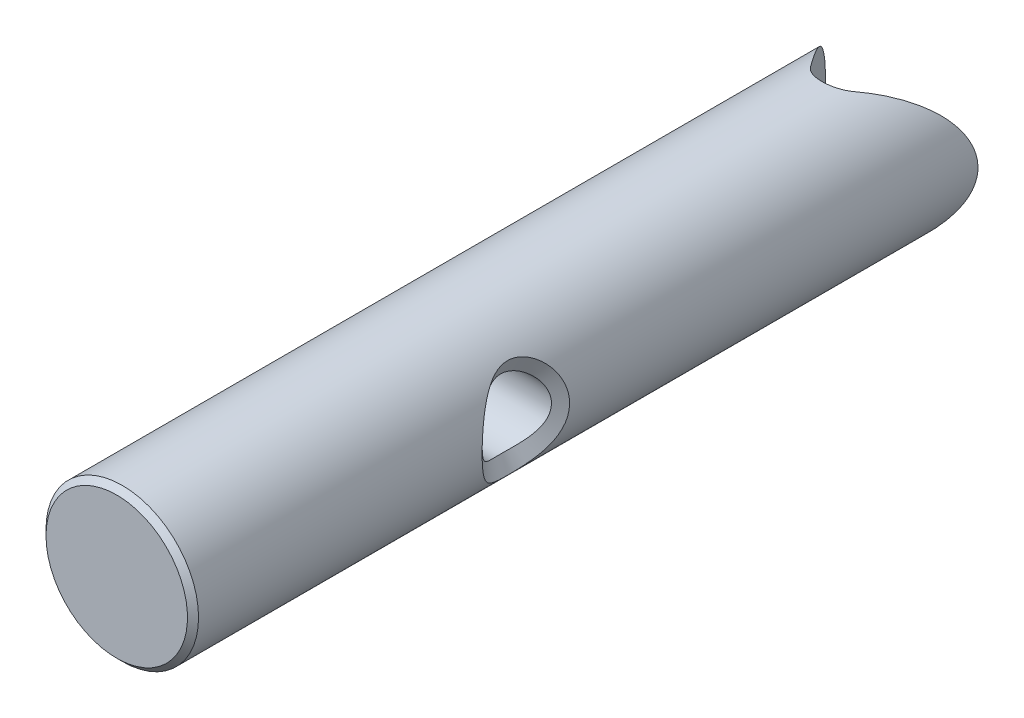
ISO-10303-21;
HEADER;
FILE_DESCRIPTION(('STEP AP214'),'2;1');
FILE_NAME('part.step','',(''),(''),'','','');
FILE_SCHEMA(('AUTOMOTIVE_DESIGN { 1 0 10303 214 1 1 1 1 }'));
ENDSEC;
DATA;
#1=APPLICATION_CONTEXT('core data for automotive mechanical design processes');
#2=APPLICATION_PROTOCOL_DEFINITION('international standard','automotive_design',2000,#1);
#3=PRODUCT_CONTEXT('',#1,'mechanical');
#4=PRODUCT('Part','Part','',(#3));
#5=PRODUCT_RELATED_PRODUCT_CATEGORY('part','',(#4));
#6=PRODUCT_DEFINITION_FORMATION('','',#4);
#7=PRODUCT_DEFINITION_CONTEXT('part definition',#1,'design');
#8=PRODUCT_DEFINITION('design','',#6,#7);
#9=PRODUCT_DEFINITION_SHAPE('','',#8);
#10=(LENGTH_UNIT() NAMED_UNIT(*) SI_UNIT(.MILLI.,.METRE.));
#11=(NAMED_UNIT(*) PLANE_ANGLE_UNIT() SI_UNIT($,.RADIAN.));
#12=(NAMED_UNIT(*) SI_UNIT($,.STERADIAN.) SOLID_ANGLE_UNIT());
#13=UNCERTAINTY_MEASURE_WITH_UNIT(LENGTH_MEASURE(1.E-05),#10,'distance_accuracy_value','');
#14=(GEOMETRIC_REPRESENTATION_CONTEXT(3) GLOBAL_UNCERTAINTY_ASSIGNED_CONTEXT((#13)) GLOBAL_UNIT_ASSIGNED_CONTEXT((#10,
#11,#12)) REPRESENTATION_CONTEXT('',''));
#15=CARTESIAN_POINT('',(0.,0.,0.));
#16=DIRECTION('',(0.,0.,1.));
#17=DIRECTION('',(1.,0.,0.));
#18=AXIS2_PLACEMENT_3D('',#15,#16,#17);
#19=CARTESIAN_POINT('',(0.,0.,16.3));
#20=DIRECTION('',(1.,0.,0.));
#21=DIRECTION('',(0.,0.,-1.));
#22=AXIS2_PLACEMENT_3D('',#19,#20,#21);
#23=CYLINDRICAL_SURFACE('',#22,1.25);
#24=CARTESIAN_POINT('',(-1.84043311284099,1.25,16.2999999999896));
#25=CARTESIAN_POINT('',(-1.84044135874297,1.24999789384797,16.3510597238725));
#26=CARTESIAN_POINT('',(-1.84386721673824,1.24684804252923,16.4021351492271));
#27=CARTESIAN_POINT('',(-1.85702622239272,1.23448964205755,16.5027637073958));
#28=CARTESIAN_POINT('',(-1.86676828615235,1.22527252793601,16.5523145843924));
#29=CARTESIAN_POINT('',(-1.88294499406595,1.20956567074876,16.61575403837));
#30=CARTESIAN_POINT('',(-1.88709963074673,1.20550730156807,16.6309029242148));
#31=CARTESIAN_POINT('',(-1.89583808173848,1.19686144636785,16.6609239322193));
#32=CARTESIAN_POINT('',(-1.90042182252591,1.19227405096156,16.6757961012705));
#33=CARTESIAN_POINT('',(-1.90998592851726,1.18258963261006,16.7052432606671));
#34=CARTESIAN_POINT('',(-1.91496629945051,1.17749260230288,16.7198182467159));
#35=CARTESIAN_POINT('',(-1.92532362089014,1.16681342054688,16.7486454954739));
#36=CARTESIAN_POINT('',(-1.93070058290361,1.16123125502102,16.7628977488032));
#37=CARTESIAN_POINT('',(-1.94734247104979,1.14375433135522,16.8052323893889));
#38=CARTESIAN_POINT('',(-1.95909842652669,1.13114906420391,16.8328324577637));
#39=CARTESIAN_POINT('',(-1.98347557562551,1.10415152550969,16.8867349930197));
#40=CARTESIAN_POINT('',(-1.99609680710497,1.08975917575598,16.9130374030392));
#41=CARTESIAN_POINT('',(-2.02579440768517,1.05476938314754,16.9719042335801));
#42=CARTESIAN_POINT('',(-2.04308450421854,1.03359559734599,17.0040202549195));
#43=CARTESIAN_POINT('',(-2.07824306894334,0.988559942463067,17.0659753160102));
#44=CARTESIAN_POINT('',(-2.09611170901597,0.964697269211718,17.0958136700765));
#45=CARTESIAN_POINT('',(-2.13176376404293,0.914326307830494,17.1532073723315));
#46=CARTESIAN_POINT('',(-2.14954720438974,0.887818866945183,17.1807634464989));
#47=CARTESIAN_POINT('',(-2.18461432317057,0.832231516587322,17.233465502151));
#48=CARTESIAN_POINT('',(-2.20189813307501,0.803152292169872,17.2586121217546));
#49=CARTESIAN_POINT('',(-2.24648159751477,0.722698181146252,17.3218959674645));
#50=CARTESIAN_POINT('',(-2.27298930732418,0.669116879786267,17.3578529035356));
#51=CARTESIAN_POINT('',(-2.32118375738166,0.555435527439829,17.4217047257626));
#52=CARTESIAN_POINT('',(-2.3428789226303,0.495347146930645,17.4496137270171));
#53=CARTESIAN_POINT('',(-2.37635746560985,0.380532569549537,17.491959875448));
#54=CARTESIAN_POINT('',(-2.38920537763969,0.326671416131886,17.5078909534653));
#55=CARTESIAN_POINT('',(-2.40907974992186,0.21623128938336,17.5324485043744));
#56=CARTESIAN_POINT('',(-2.41610983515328,0.159654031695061,17.5410795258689));
#57=CARTESIAN_POINT('',(-2.42189153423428,0.0739401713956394,17.5481444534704));
#58=CARTESIAN_POINT('',(-2.42302212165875,0.0451646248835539,17.5495157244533));
#59=CARTESIAN_POINT('',(-2.42364327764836,-0.0124266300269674,17.5502699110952));
#60=CARTESIAN_POINT('',(-2.42313405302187,-0.0412423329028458,17.5496530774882));
#61=CARTESIAN_POINT('',(-2.41916381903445,-0.12740630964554,17.5448153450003));
#62=CARTESIAN_POINT('',(-2.41326339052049,-0.184518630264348,17.5376110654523));
#63=CARTESIAN_POINT('',(-2.39593295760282,-0.293534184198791,17.5162577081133));
#64=CARTESIAN_POINT('',(-2.38478511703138,-0.34555571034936,17.5024625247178));
#65=CARTESIAN_POINT('',(-2.35798979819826,-0.4464170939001,17.4687774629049));
#66=CARTESIAN_POINT('',(-2.34233712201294,-0.49525319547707,17.4488805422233));
#67=CARTESIAN_POINT('',(-2.31298077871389,-0.574441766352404,17.4107679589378));
#68=CARTESIAN_POINT('',(-2.30018133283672,-0.605824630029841,17.3939489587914));
#69=CARTESIAN_POINT('',(-2.27325728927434,-0.666601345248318,17.3580111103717));
#70=CARTESIAN_POINT('',(-2.25913388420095,-0.695996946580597,17.3388943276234));
#71=CARTESIAN_POINT('',(-2.22991374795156,-0.752838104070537,17.2984757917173));
#72=CARTESIAN_POINT('',(-2.21481496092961,-0.780279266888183,17.2771693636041));
#73=CARTESIAN_POINT('',(-2.18402034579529,-0.833105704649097,17.2325397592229));
#74=CARTESIAN_POINT('',(-2.16832433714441,-0.858490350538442,17.2092159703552));
#75=CARTESIAN_POINT('',(-2.12025912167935,-0.932226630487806,17.1356595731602));
#76=CARTESIAN_POINT('',(-2.08734959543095,-0.977338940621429,17.082429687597));
#77=CARTESIAN_POINT('',(-2.03942938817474,-1.03815397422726,16.9971027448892));
#78=CARTESIAN_POINT('',(-2.02370388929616,-1.05727585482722,16.9677621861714));
#79=CARTESIAN_POINT('',(-1.99312054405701,-1.09319326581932,16.9071819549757));
#80=CARTESIAN_POINT('',(-1.97826393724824,-1.10998551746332,16.875939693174));
#81=CARTESIAN_POINT('',(-1.94280280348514,-1.1488889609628,16.7954197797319));
#82=CARTESIAN_POINT('',(-1.9230662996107,-1.16942652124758,16.7449754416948));
#83=CARTESIAN_POINT('',(-1.88877672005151,-1.20404733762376,16.6402773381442));
#84=CARTESIAN_POINT('',(-1.87421115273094,-1.21814617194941,16.5860331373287));
#85=CARTESIAN_POINT('',(-1.85860371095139,-1.23302010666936,16.5067470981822));
#86=CARTESIAN_POINT('',(-1.85459858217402,-1.23679749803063,16.4828187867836));
#87=CARTESIAN_POINT('',(-1.84804109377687,-1.24297099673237,16.4345898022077));
#88=CARTESIAN_POINT('',(-1.845488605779,-1.24536722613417,16.4102891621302));
#89=CARTESIAN_POINT('',(-1.84011171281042,-1.25040135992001,16.3371092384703));
#90=CARTESIAN_POINT('',(-1.83955254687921,-1.25089914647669,16.2878758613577));
#91=CARTESIAN_POINT('',(-1.84462048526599,-1.24612045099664,16.1900867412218));
#92=CARTESIAN_POINT('',(-1.85024177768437,-1.240849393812,16.1415304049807));
#93=CARTESIAN_POINT('',(-1.86708208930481,-1.22493841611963,16.0462918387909));
#94=CARTESIAN_POINT('',(-1.87830891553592,-1.21429100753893,15.9996123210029));
#95=CARTESIAN_POINT('',(-1.90985249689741,-1.18309265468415,15.8912451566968));
#96=CARTESIAN_POINT('',(-1.93200569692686,-1.16030338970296,15.8307443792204));
#97=CARTESIAN_POINT('',(-1.98122607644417,-1.10678234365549,15.7155372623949));
#98=CARTESIAN_POINT('',(-2.00830291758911,-1.07603489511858,15.6608426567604));
#99=CARTESIAN_POINT('',(-2.06519790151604,-1.00619848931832,15.5555723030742));
#100=CARTESIAN_POINT('',(-2.09507641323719,-0.966871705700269,15.5051872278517));
#101=CARTESIAN_POINT('',(-2.1396191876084,-0.902459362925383,15.4345051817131));
#102=CARTESIAN_POINT('',(-2.15441765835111,-0.880090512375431,15.4117649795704));
#103=CARTESIAN_POINT('',(-2.18368787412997,-0.833527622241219,15.3679293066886));
#104=CARTESIAN_POINT('',(-2.19815915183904,-0.809331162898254,15.3468360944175));
#105=CARTESIAN_POINT('',(-2.24049455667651,-0.734286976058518,15.2863741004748));
#106=CARTESIAN_POINT('',(-2.26743477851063,-0.680768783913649,15.2495852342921));
#107=CARTESIAN_POINT('',(-2.31664717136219,-0.567095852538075,15.1841197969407));
#108=CARTESIAN_POINT('',(-2.33892721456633,-0.506952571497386,15.155429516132));
#109=CARTESIAN_POINT('',(-2.37336411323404,-0.392019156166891,15.1117631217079));
#110=CARTESIAN_POINT('',(-2.38661112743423,-0.338140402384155,15.0952642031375));
#111=CARTESIAN_POINT('',(-2.40734695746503,-0.227602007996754,15.0695899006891));
#112=CARTESIAN_POINT('',(-2.41484044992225,-0.170944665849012,15.0604085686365));
#113=CARTESIAN_POINT('',(-2.42343745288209,-0.0561958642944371,15.0499313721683));
#114=CARTESIAN_POINT('',(-2.42451747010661,0.0019000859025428,15.0486644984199));
#115=CARTESIAN_POINT('',(-2.41996742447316,0.117443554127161,15.0541857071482));
#116=CARTESIAN_POINT('',(-2.41433630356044,0.17489096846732,15.0609750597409));
#117=CARTESIAN_POINT('',(-2.39758410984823,0.284290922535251,15.0815544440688));
#118=CARTESIAN_POINT('',(-2.38678236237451,0.336371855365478,15.0949384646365));
#119=CARTESIAN_POINT('',(-2.36064466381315,0.437410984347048,15.1278236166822));
#120=CARTESIAN_POINT('',(-2.34530384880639,0.486365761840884,15.1473313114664));
#121=CARTESIAN_POINT('',(-2.31641214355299,0.565660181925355,15.1847393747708));
#122=CARTESIAN_POINT('',(-2.30380413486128,0.597029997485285,15.2012314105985));
#123=CARTESIAN_POINT('',(-2.27729987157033,0.657825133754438,15.2365154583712));
#124=CARTESIAN_POINT('',(-2.2634047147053,0.687252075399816,15.2553055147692));
#125=CARTESIAN_POINT('',(-2.22017615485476,0.772660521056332,15.3149485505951));
#126=CARTESIAN_POINT('',(-2.18933734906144,0.825671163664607,15.3590270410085));
#127=CARTESIAN_POINT('',(-2.12586457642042,0.924123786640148,15.4554144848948));
#128=CARTESIAN_POINT('',(-2.09321040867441,0.969438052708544,15.5078386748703));
#129=CARTESIAN_POINT('',(-2.0294658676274,1.05118745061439,15.6200633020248));
#130=CARTESIAN_POINT('',(-1.998374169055,1.08763021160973,15.6798573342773));
#131=CARTESIAN_POINT('',(-1.94801960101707,1.14334294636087,15.7918549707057));
#132=CARTESIAN_POINT('',(-1.92769019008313,1.16463584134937,15.842568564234));
#133=CARTESIAN_POINT('',(-1.89215856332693,1.20067952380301,15.9479357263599));
#134=CARTESIAN_POINT('',(-1.87694355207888,1.21544666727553,16.0025790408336));
#135=CARTESIAN_POINT('',(-1.85732578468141,1.23420290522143,16.0979081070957));
#136=CARTESIAN_POINT('',(-1.85104615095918,1.24009928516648,16.1378341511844));
#137=CARTESIAN_POINT('',(-1.84259710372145,1.24799812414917,16.2185036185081));
#138=CARTESIAN_POINT('',(-1.84042653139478,1.25000168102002,16.2592468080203));
#139=CARTESIAN_POINT('',(-1.84043311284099,1.25,16.2999999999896));
#140=B_SPLINE_CURVE_WITH_KNOTS('',3,(#24,#25,#26,#27,#28,#29,#30,#31,#32,#33,#34,#35,#36,#37,
#38,#39,#40,#41,#42,#43,#44,#45,#46,#47,#48,#49,#50,#51,#52,#53,#54,#55,#56,#57,#58,#59,#60,#61,
#62,#63,#64,#65,#66,#67,#68,#69,#70,#71,#72,#73,#74,#75,#76,#77,#78,#79,#80,#81,#82,#83,#84,#85,
#86,#87,#88,#89,#90,#91,#92,#93,#94,#95,#96,#97,#98,#99,#100,#101,#102,#103,#104,#105,#106,#107,
#108,#109,#110,#111,#112,#113,#114,#115,#116,#117,#118,#119,#120,#121,#122,#123,#124,#125,#126,
#127,#128,#129,#130,#131,#132,#133,#134,#135,#136,#137,#138,#139),.UNSPECIFIED.,.T.,.F.,(4,2,2,
2,2,2,2,2,2,2,2,2,2,2,2,2,2,2,2,2,2,2,2,2,2,2,2,2,2,2,2,2,2,2,2,2,2,2,2,2,2,2,2,2,2,2,2,2,2,2,2,
2,2,2,2,2,2,4),(0.,0.153026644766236,0.306269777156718,0.354933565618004,0.403589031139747,
0.45224519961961,0.500902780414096,0.598416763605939,0.695935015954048,0.822291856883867,
0.948686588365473,1.0750409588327,1.20136177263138,1.40978943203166,1.61784927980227,
1.78999153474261,1.96202645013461,2.04841704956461,2.13479675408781,2.30741588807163,
2.47166016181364,2.63609471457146,2.74946577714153,2.86273567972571,2.97625264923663,
3.08980421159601,3.32017725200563,3.4352530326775,3.5504891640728,3.72369372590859,
3.89647697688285,3.97006425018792,4.04364501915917,4.19057274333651,4.33736241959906,
4.48435710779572,4.68826566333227,4.89257875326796,5.10350640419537,5.20892294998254,
5.31448160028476,5.52454004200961,5.73424072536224,5.90715984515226,6.07993826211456,
6.25334919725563,6.42678747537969,6.59067688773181,6.75474255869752,6.86745139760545,
6.98006498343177,7.20563457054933,7.4346432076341,7.66345420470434,7.83881229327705,
8.01372834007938,8.13590063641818,8.25803847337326),.UNSPECIFIED.);
#141=CARTESIAN_POINT('',(-1.84043311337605,1.24999999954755,16.299966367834));
#142=VERTEX_POINT('',#141);
#143=EDGE_CURVE('E22',#142,#142,#140,.T.);
#144=ORIENTED_EDGE('',*,*,#143,.F.);
#145=EDGE_LOOP('',(#144));
#146=FACE_BOUND('',#145,.T.);
#147=CARTESIAN_POINT('',(1.84042995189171,1.24999999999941,16.3000012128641));
#148=CARTESIAN_POINT('',(1.84043636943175,1.24999755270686,16.2482176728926));
#149=CARTESIAN_POINT('',(1.84396263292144,1.24675709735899,16.1964149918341));
#150=CARTESIAN_POINT('',(1.85749252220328,1.23404949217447,16.0943946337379));
#151=CARTESIAN_POINT('',(1.86750607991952,1.22457279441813,16.044179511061));
#152=CARTESIAN_POINT('',(1.88406372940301,1.20847146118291,15.9800806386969));
#153=CARTESIAN_POINT('',(1.88828086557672,1.20434473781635,15.9648877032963));
#154=CARTESIAN_POINT('',(1.89714204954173,1.19555900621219,15.9347823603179));
#155=CARTESIAN_POINT('',(1.90178601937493,1.19090009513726,15.9198699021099));
#156=CARTESIAN_POINT('',(1.9114740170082,1.18107029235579,15.8903475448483));
#157=CARTESIAN_POINT('',(1.91651804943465,1.1758993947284,15.875737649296));
#158=CARTESIAN_POINT('',(1.92700280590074,1.16507021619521,15.8468449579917));
#159=CARTESIAN_POINT('',(1.9324435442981,1.15941191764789,15.8325621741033));
#160=CARTESIAN_POINT('',(1.94926875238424,1.14170249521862,15.7901412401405));
#161=CARTESIAN_POINT('',(1.96113654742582,1.12893646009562,15.7624890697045));
#162=CARTESIAN_POINT('',(1.98572639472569,1.10160691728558,15.7084953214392));
#163=CARTESIAN_POINT('',(1.99844848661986,1.08704332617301,15.6821538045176));
#164=CARTESIAN_POINT('',(2.02830970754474,1.05172346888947,15.623337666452));
#165=CARTESIAN_POINT('',(2.04565728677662,1.03039807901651,15.5913076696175));
#166=CARTESIAN_POINT('',(2.08089127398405,0.985066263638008,15.5295359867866));
#167=CARTESIAN_POINT('',(2.09877784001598,0.961059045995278,15.4997949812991));
#168=CARTESIAN_POINT('',(2.15227140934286,0.885083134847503,15.4140228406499));
#169=CARTESIAN_POINT('',(2.1877625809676,0.82910434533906,15.3613500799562));
#170=CARTESIAN_POINT('',(2.24891468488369,0.717945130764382,15.2747694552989));
#171=CARTESIAN_POINT('',(2.27520031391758,0.664400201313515,15.2391903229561));
#172=CARTESIAN_POINT('',(2.32293677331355,0.550830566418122,15.1760409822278));
#173=CARTESIAN_POINT('',(2.34439598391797,0.490817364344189,15.1484568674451));
#174=CARTESIAN_POINT('',(2.37747972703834,0.37607492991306,15.1066281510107));
#175=CARTESIAN_POINT('',(2.39015726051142,0.322189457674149,15.0909110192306));
#176=CARTESIAN_POINT('',(2.40969950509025,0.211778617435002,15.0667789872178));
#177=CARTESIAN_POINT('',(2.4165677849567,0.155254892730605,15.0583596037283));
#178=CARTESIAN_POINT('',(2.42392648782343,0.0409814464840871,15.0493540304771));
#179=CARTESIAN_POINT('',(2.42439654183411,-0.0167716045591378,15.0487928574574));
#180=CARTESIAN_POINT('',(2.41882184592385,-0.131487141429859,15.0556071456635));
#181=CARTESIAN_POINT('',(2.41277624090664,-0.18844952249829,15.062983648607));
#182=CARTESIAN_POINT('',(2.39519475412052,-0.297246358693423,15.0846488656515));
#183=CARTESIAN_POINT('',(2.38393280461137,-0.349195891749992,15.0985932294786));
#184=CARTESIAN_POINT('',(2.35692522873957,-0.44992696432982,15.1325668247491));
#185=CARTESIAN_POINT('',(2.34116957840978,-0.498701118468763,15.1526096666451));
#186=CARTESIAN_POINT('',(2.29953873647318,-0.61015983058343,15.2066717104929));
#187=CARTESIAN_POINT('',(2.27209343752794,-0.67108482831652,15.2431076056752));
#188=CARTESIAN_POINT('',(2.21340802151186,-0.784751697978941,15.3245193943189));
#189=CARTESIAN_POINT('',(2.18216759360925,-0.837492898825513,15.3694959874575));
#190=CARTESIAN_POINT('',(2.13420170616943,-0.910674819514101,15.4430325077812));
#191=CARTESIAN_POINT('',(2.11788390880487,-0.934256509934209,15.4688048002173));
#192=CARTESIAN_POINT('',(2.08536760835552,-0.979185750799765,15.522239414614));
#193=CARTESIAN_POINT('',(2.06916900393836,-1.00053547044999,15.5498998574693));
#194=CARTESIAN_POINT('',(2.02121988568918,-1.06114501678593,15.6356371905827));
#195=CARTESIAN_POINT('',(1.99006936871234,-1.09703397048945,15.6965390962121));
#196=CARTESIAN_POINT('',(1.94084153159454,-1.15097958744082,15.8094905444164));
#197=CARTESIAN_POINT('',(1.92144850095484,-1.17125084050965,15.8598987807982));
#198=CARTESIAN_POINT('',(1.89610359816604,-1.19682420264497,15.9382445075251));
#199=CARTESIAN_POINT('',(1.88828218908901,-1.20454058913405,15.9648022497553));
#200=CARTESIAN_POINT('',(1.87415113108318,-1.21826650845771,16.0187516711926));
#201=CARTESIAN_POINT('',(1.86784109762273,-1.22427647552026,16.0461431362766));
#202=CARTESIAN_POINT('',(1.85785684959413,-1.23373236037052,16.0975566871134));
#203=CARTESIAN_POINT('',(1.8539318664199,-1.23742497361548,16.121484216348));
#204=CARTESIAN_POINT('',(1.84756271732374,-1.24342812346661,16.1696988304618));
#205=CARTESIAN_POINT('',(1.8451184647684,-1.24573874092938,16.1939858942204));
#206=CARTESIAN_POINT('',(1.84005661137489,-1.25051678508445,16.2671221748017));
#207=CARTESIAN_POINT('',(1.83969531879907,-1.25084422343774,16.3163206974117));
#208=CARTESIAN_POINT('',(1.84369582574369,-1.24703097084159,16.389535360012));
#209=CARTESIAN_POINT('',(1.84578586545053,-1.24504299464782,16.4138401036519));
#210=CARTESIAN_POINT('',(1.85145021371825,-1.23967910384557,16.4621238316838));
#211=CARTESIAN_POINT('',(1.85502437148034,-1.23630333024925,16.4861028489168));
#212=CARTESIAN_POINT('',(1.86783696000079,-1.22416907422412,16.5573569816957));
#213=CARTESIAN_POINT('',(1.87916397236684,-1.2134050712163,16.6039237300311));
#214=CARTESIAN_POINT('',(1.91100677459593,-1.18187296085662,16.7123091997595));
#215=CARTESIAN_POINT('',(1.93338465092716,-1.15883379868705,16.7729027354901));
#216=CARTESIAN_POINT('',(1.98300420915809,-1.10477082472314,16.8882731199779));
#217=CARTESIAN_POINT('',(2.01025573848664,-1.07373078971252,16.943037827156));
#218=CARTESIAN_POINT('',(2.06745906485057,-1.00326490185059,17.0483976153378));
#219=CARTESIAN_POINT('',(2.09746996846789,-0.963598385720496,17.0987982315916));
#220=CARTESIAN_POINT('',(2.15709836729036,-0.876934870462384,17.1930756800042));
#221=CARTESIAN_POINT('',(2.18671603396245,-0.829941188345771,17.2369554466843));
#222=CARTESIAN_POINT('',(2.24302065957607,-0.729371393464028,17.3171543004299));
#223=CARTESIAN_POINT('',(2.26973766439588,-0.675878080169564,17.3535552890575));
#224=CARTESIAN_POINT('',(2.31849145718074,-0.562269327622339,17.4183082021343));
#225=CARTESIAN_POINT('',(2.34053337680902,-0.502161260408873,17.4466689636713));
#226=CARTESIAN_POINT('',(2.37458214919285,-0.387284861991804,17.4897861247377));
#227=CARTESIAN_POINT('',(2.38766778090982,-0.333407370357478,17.5060510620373));
#228=CARTESIAN_POINT('',(2.40804945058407,-0.222913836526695,17.5312644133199));
#229=CARTESIAN_POINT('',(2.41535015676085,-0.166300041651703,17.5402187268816));
#230=CARTESIAN_POINT('',(2.42358281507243,-0.0517004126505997,17.5502583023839));
#231=CARTESIAN_POINT('',(2.42449220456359,0.0062895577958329,17.5513156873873));
#232=CARTESIAN_POINT('',(2.4196310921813,0.121578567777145,17.5454121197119));
#233=CARTESIAN_POINT('',(2.41385942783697,0.1788774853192,17.5384497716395));
#234=CARTESIAN_POINT('',(2.39685665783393,0.288094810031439,17.5175521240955));
#235=CARTESIAN_POINT('',(2.38592958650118,0.340137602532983,17.5040040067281));
#236=CARTESIAN_POINT('',(2.35955478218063,0.441075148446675,17.4708026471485));
#237=CARTESIAN_POINT('',(2.3441021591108,0.489966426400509,17.4511427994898));
#238=CARTESIAN_POINT('',(2.31502335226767,0.569202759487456,17.413458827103));
#239=CARTESIAN_POINT('',(2.30232945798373,0.600578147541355,17.3968352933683));
#240=CARTESIAN_POINT('',(2.27565947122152,0.661371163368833,17.3612851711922));
#241=CARTESIAN_POINT('',(2.26168447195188,0.69079042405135,17.3423605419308));
#242=CARTESIAN_POINT('',(2.21822832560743,0.776160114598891,17.2823058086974));
#243=CARTESIAN_POINT('',(2.18725463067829,0.829122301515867,17.2379433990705));
#244=CARTESIAN_POINT('',(2.12356429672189,0.927427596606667,17.1409703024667));
#245=CARTESIAN_POINT('',(2.09082827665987,0.972642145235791,17.088244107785));
#246=CARTESIAN_POINT('',(2.02701353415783,1.05415028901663,16.975351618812));
#247=CARTESIAN_POINT('',(1.99593331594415,1.09045204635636,16.9151922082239));
#248=CARTESIAN_POINT('',(1.95667484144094,1.13370443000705,16.8272033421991));
#249=CARTESIAN_POINT('',(1.94623242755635,1.14491055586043,16.8024216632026));
#250=CARTESIAN_POINT('',(1.92639436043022,1.16580386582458,16.7518313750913));
#251=CARTESIAN_POINT('',(1.9169984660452,1.17549140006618,16.726023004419));
#252=CARTESIAN_POINT('',(1.89075327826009,1.20207775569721,16.6472291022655));
#253=CARTESIAN_POINT('',(1.8757765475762,1.21657536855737,16.5927242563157));
#254=CARTESIAN_POINT('',(1.85669014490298,1.23479944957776,16.4982694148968));
#255=CARTESIAN_POINT('',(1.85064846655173,1.24047455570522,16.4590761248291));
#256=CARTESIAN_POINT('',(1.84251688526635,1.24807483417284,16.3799258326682));
#257=CARTESIAN_POINT('',(1.8404249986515,1.25000188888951,16.3399692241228));
#258=CARTESIAN_POINT('',(1.84042995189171,1.24999999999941,16.3000012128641));
#259=B_SPLINE_CURVE_WITH_KNOTS('',3,(#147,#148,#149,#150,#151,#152,#153,#154,#155,#156,#157,
#158,#159,#160,#161,#162,#163,#164,#165,#166,#167,#168,#169,#170,#171,#172,#173,#174,#175,#176,
#177,#178,#179,#180,#181,#182,#183,#184,#185,#186,#187,#188,#189,#190,#191,#192,#193,#194,#195,
#196,#197,#198,#199,#200,#201,#202,#203,#204,#205,#206,#207,#208,#209,#210,#211,#212,#213,#214,
#215,#216,#217,#218,#219,#220,#221,#222,#223,#224,#225,#226,#227,#228,#229,#230,#231,#232,#233,
#234,#235,#236,#237,#238,#239,#240,#241,#242,#243,#244,#245,#246,#247,#248,#249,#250,#251,#252,
#253,#254,#255,#256,#257,#258),.UNSPECIFIED.,.T.,.F.,(4,2,2,2,2,2,2,2,2,2,2,2,2,2,2,2,2,2,2,2,2,
2,2,2,2,2,2,2,2,2,2,2,2,2,2,2,2,2,2,2,2,2,2,2,2,2,2,2,2,2,2,2,2,2,2,4),(0.,0.155196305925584,
0.310630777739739,0.359517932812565,0.408396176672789,0.457274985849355,0.506155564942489,
0.604110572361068,0.702070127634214,0.828522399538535,0.955012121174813,1.2076381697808,
1.41524435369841,1.62248723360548,1.79439413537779,1.96619535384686,2.13854338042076,
2.31091402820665,2.47511117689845,2.63967749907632,2.86679696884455,3.09393505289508,
3.20950566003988,3.32496288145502,3.55555639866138,3.72799195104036,3.81412917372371,
3.90024445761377,3.9737385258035,4.04722829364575,4.19397997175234,4.26733774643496,
4.34068806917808,4.48746432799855,4.69210893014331,4.89717179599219,5.10892853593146,
5.32058969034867,5.5297922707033,5.73876401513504,5.91137304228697,6.08384263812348,
6.25692078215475,6.43002904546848,6.59400616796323,6.75816113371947,6.8711434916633,
6.98403031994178,7.21015293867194,7.43972519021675,7.66908641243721,7.75642256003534,
7.84373854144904,8.01782917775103,8.13767431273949,8.25745924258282),.UNSPECIFIED.);
#260=CARTESIAN_POINT('',(1.84042995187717,1.24999999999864,16.3000018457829));
#261=VERTEX_POINT('',#260);
#262=EDGE_CURVE('E67',#261,#261,#259,.T.);
#263=ORIENTED_EDGE('',*,*,#262,.F.);
#264=EDGE_LOOP('',(#263));
#265=FACE_BOUND('',#264,.T.);
#266=ADVANCED_FACE('F15',(#146,#265),#23,.F.);
#267=CARTESIAN_POINT('',(0.,0.,28.3));
#268=DIRECTION('',(0.,0.,-1.));
#269=DIRECTION('',(-1.,0.,0.));
#270=AXIS2_PLACEMENT_3D('',#267,#268,#269);
#271=PLANE('',#270);
#272=CARTESIAN_POINT('',(0.,0.,28.3000000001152));
#273=DIRECTION('',(0.,0.,-1.));
#274=DIRECTION('',(-1.,0.,0.));
#275=AXIS2_PLACEMENT_3D('',#272,#273,#274);
#276=CIRCLE('',#275,2.55000000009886);
#277=CARTESIAN_POINT('',(-2.55000000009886,0.,28.3000000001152));
#278=VERTEX_POINT('',#277);
#279=EDGE_CURVE('E64',#278,#278,#276,.T.);
#280=ORIENTED_EDGE('',*,*,#279,.F.);
#281=EDGE_LOOP('',(#280));
#282=FACE_BOUND('',#281,.T.);
#283=ADVANCED_FACE('F81',(#282),#271,.F.);
#284=CARTESIAN_POINT('',(2.75,0.,0.));
#285=DIRECTION('',(0.786318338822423,0.,0.617821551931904));
#286=DIRECTION('',(0.617821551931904,0.,-0.786318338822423));
#287=AXIS2_PLACEMENT_3D('',#284,#285,#286);
#288=PLANE('',#287);
#289=DIRECTION('',(0.,1.,0.));
#290=VECTOR('',#289,1.);
#291=CARTESIAN_POINT('',(0.786318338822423,0.,2.4992312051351));
#292=LINE('',#291,#290);
#293=CARTESIAN_POINT('',(0.786318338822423,-2.63518566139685,2.4992312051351));
#294=VERTEX_POINT('',#293);
#295=CARTESIAN_POINT('',(0.786318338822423,2.63518566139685,2.4992312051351));
#296=VERTEX_POINT('',#295);
#297=EDGE_CURVE('E49',#294,#296,#292,.T.);
#298=ORIENTED_EDGE('',*,*,#297,.T.);
#299=CARTESIAN_POINT('',(0.,0.,3.5));
#300=DIRECTION('',(0.786318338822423,0.,0.617821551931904));
#301=DIRECTION('',(-0.617821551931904,0.,0.786318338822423));
#302=AXIS2_PLACEMENT_3D('',#299,#300,#301);
#303=ELLIPSE('',#302,4.45112345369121,2.75);
#304=EDGE_CURVE('E47',#294,#296,#303,.T.);
#305=ORIENTED_EDGE('',*,*,#304,.F.);
#306=EDGE_LOOP('',(#298,#305));
#307=FACE_BOUND('',#306,.T.);
#308=ADVANCED_FACE('F51',(#307),#288,.F.);
#309=CARTESIAN_POINT('',(-0.786318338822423,0.,2.4992312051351));
#310=DIRECTION('',(-0.786318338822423,0.,0.617821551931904));
#311=DIRECTION('',(0.617821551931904,0.,0.786318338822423));
#312=AXIS2_PLACEMENT_3D('',#309,#310,#311);
#313=PLANE('',#312);
#314=DIRECTION('',(0.,1.,0.));
#315=VECTOR('',#314,1.);
#316=CARTESIAN_POINT('',(-0.786318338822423,0.,2.4992312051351));
#317=LINE('',#316,#315);
#318=CARTESIAN_POINT('',(-0.786318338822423,2.63518566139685,2.4992312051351));
#319=VERTEX_POINT('',#318);
#320=CARTESIAN_POINT('',(-0.786318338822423,-2.63518566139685,2.4992312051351));
#321=VERTEX_POINT('',#320);
#322=EDGE_CURVE('E39',#319,#321,#317,.F.);
#323=ORIENTED_EDGE('',*,*,#322,.T.);
#324=CARTESIAN_POINT('',(0.,0.,3.5));
#325=DIRECTION('',(-0.786318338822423,0.,0.617821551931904));
#326=DIRECTION('',(0.617821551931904,0.,0.786318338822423));
#327=AXIS2_PLACEMENT_3D('',#324,#325,#326);
#328=ELLIPSE('',#327,4.45112345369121,2.75);
#329=EDGE_CURVE('E60',#319,#321,#328,.T.);
#330=ORIENTED_EDGE('',*,*,#329,.F.);
#331=EDGE_LOOP('',(#323,#330));
#332=FACE_BOUND('',#331,.T.);
#333=ADVANCED_FACE('F89',(#332),#313,.F.);
#334=CARTESIAN_POINT('',(0.,0.,1.88140965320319));
#335=DIRECTION('',(0.,1.,0.));
#336=DIRECTION('',(0.,0.,1.));
#337=AXIS2_PLACEMENT_3D('',#334,#335,#336);
#338=CYLINDRICAL_SURFACE('',#337,1.);
#339=ORIENTED_EDGE('',*,*,#297,.F.);
#340=CARTESIAN_POINT('',(-0.786318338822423,-2.63518566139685,2.4992312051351));
#341=CARTESIAN_POINT('',(-0.751487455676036,-2.64559795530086,2.54360183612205));
#342=CARTESIAN_POINT('',(-0.712900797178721,-2.65634349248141,2.58494782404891));
#343=CARTESIAN_POINT('',(-0.629199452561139,-2.67739504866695,2.66069543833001));
#344=CARTESIAN_POINT('',(-0.584073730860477,-2.68770028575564,2.69508508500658));
#345=CARTESIAN_POINT('',(-0.488344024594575,-2.70673389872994,2.75590487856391));
#346=CARTESIAN_POINT('',(-0.437733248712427,-2.71546028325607,2.78232500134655));
#347=CARTESIAN_POINT('',(-0.332472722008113,-2.7303438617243,2.82624151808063));
#348=CARTESIAN_POINT('',(-0.277827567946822,-2.7365039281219,2.84374789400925));
#349=CARTESIAN_POINT('',(-0.168056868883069,-2.74539273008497,2.86873577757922));
#350=CARTESIAN_POINT('',(-0.113016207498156,-2.74823480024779,2.87654901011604));
#351=CARTESIAN_POINT('',(-0.00232294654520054,-2.75055569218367,2.88294174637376));
#352=CARTESIAN_POINT('',(0.053329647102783,-2.75003454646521,2.88152133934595));
#353=CARTESIAN_POINT('',(0.161096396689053,-2.74578448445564,2.86977151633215));
#354=CARTESIAN_POINT('',(0.213259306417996,-2.74219574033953,2.85983135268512));
#355=CARTESIAN_POINT('',(0.315132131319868,-2.73236382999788,2.83192613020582));
#356=CARTESIAN_POINT('',(0.364841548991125,-2.72612012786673,2.81395945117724));
#357=CARTESIAN_POINT('',(0.461490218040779,-2.71145072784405,2.77017172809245));
#358=CARTESIAN_POINT('',(0.508357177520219,-2.70298511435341,2.74420531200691));
#359=CARTESIAN_POINT('',(0.597169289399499,-2.68476128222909,2.68529069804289));
#360=CARTESIAN_POINT('',(0.639117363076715,-2.6750038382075,2.65234667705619));
#361=CARTESIAN_POINT('',(0.697713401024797,-2.66009517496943,2.59828297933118));
#362=CARTESIAN_POINT('',(0.716552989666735,-2.65507134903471,2.57945080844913));
#363=CARTESIAN_POINT('',(0.752637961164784,-2.6450680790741,2.54037916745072));
#364=CARTESIAN_POINT('',(0.769886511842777,-2.64008856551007,2.52014264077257));
#365=CARTESIAN_POINT('',(0.786318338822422,-2.63518566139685,2.4992312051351));
#366=B_SPLINE_CURVE_WITH_KNOTS('',3,(#340,#341,#342,#343,#344,#345,#346,#347,#348,#349,#350,
#351,#352,#353,#354,#355,#356,#357,#358,#359,#360,#361,#362,#363,#364,#365),.UNSPECIFIED.,.F.,
.F.,(4,2,2,2,2,2,2,2,2,2,2,2,4),(0.,0.171896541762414,0.344086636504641,0.516492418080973,
0.688704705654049,0.854844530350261,1.0209827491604,1.17991193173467,1.33887320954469,
1.50091299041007,1.66285604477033,1.74410687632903,1.8251922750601),.UNSPECIFIED.);
#367=EDGE_CURVE('E63',#321,#294,#366,.T.);
#368=ORIENTED_EDGE('',*,*,#367,.F.);
#369=ORIENTED_EDGE('',*,*,#322,.F.);
#370=CARTESIAN_POINT('',(0.786318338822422,2.63518566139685,2.4992312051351));
#371=CARTESIAN_POINT('',(0.751487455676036,2.64559795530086,2.54360183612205));
#372=CARTESIAN_POINT('',(0.71290079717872,2.65634349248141,2.58494782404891));
#373=CARTESIAN_POINT('',(0.629199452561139,2.67739504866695,2.66069543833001));
#374=CARTESIAN_POINT('',(0.584073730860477,2.68770028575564,2.69508508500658));
#375=CARTESIAN_POINT('',(0.488344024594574,2.70673389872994,2.75590487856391));
#376=CARTESIAN_POINT('',(0.437733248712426,2.71546028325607,2.78232500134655));
#377=CARTESIAN_POINT('',(0.332472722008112,2.7303438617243,2.82624151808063));
#378=CARTESIAN_POINT('',(0.277827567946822,2.7365039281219,2.84374789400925));
#379=CARTESIAN_POINT('',(0.168056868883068,2.74539273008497,2.86873577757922));
#380=CARTESIAN_POINT('',(0.113016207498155,2.74823480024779,2.87654901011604));
#381=CARTESIAN_POINT('',(0.00232294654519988,2.75055569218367,2.88294174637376));
#382=CARTESIAN_POINT('',(-0.0533296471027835,2.75003454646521,2.88152133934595));
#383=CARTESIAN_POINT('',(-0.161096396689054,2.74578448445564,2.86977151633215));
#384=CARTESIAN_POINT('',(-0.213259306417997,2.74219574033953,2.85983135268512));
#385=CARTESIAN_POINT('',(-0.315132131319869,2.73236382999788,2.83192613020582));
#386=CARTESIAN_POINT('',(-0.364841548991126,2.72612012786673,2.81395945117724));
#387=CARTESIAN_POINT('',(-0.461490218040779,2.71145072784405,2.77017172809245));
#388=CARTESIAN_POINT('',(-0.50835717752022,2.70298511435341,2.74420531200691));
#389=CARTESIAN_POINT('',(-0.5971692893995,2.68476128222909,2.68529069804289));
#390=CARTESIAN_POINT('',(-0.639117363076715,2.6750038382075,2.65234667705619));
#391=CARTESIAN_POINT('',(-0.697713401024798,2.66009517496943,2.59828297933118));
#392=CARTESIAN_POINT('',(-0.716552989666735,2.65507134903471,2.57945080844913));
#393=CARTESIAN_POINT('',(-0.752637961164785,2.6450680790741,2.54037916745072));
#394=CARTESIAN_POINT('',(-0.769886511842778,2.64008856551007,2.52014264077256));
#395=CARTESIAN_POINT('',(-0.786318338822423,2.63518566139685,2.4992312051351));
#396=B_SPLINE_CURVE_WITH_KNOTS('',3,(#370,#371,#372,#373,#374,#375,#376,#377,#378,#379,#380,
#381,#382,#383,#384,#385,#386,#387,#388,#389,#390,#391,#392,#393,#394,#395),.UNSPECIFIED.,.F.,
.F.,(4,2,2,2,2,2,2,2,2,2,2,2,4),(0.,0.171896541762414,0.34408663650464,0.516492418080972,
0.688704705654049,0.854844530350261,1.0209827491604,1.17991193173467,1.33887320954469,
1.50091299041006,1.66285604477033,1.74410687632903,1.8251922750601),.UNSPECIFIED.);
#397=EDGE_CURVE('E56',#296,#319,#396,.T.);
#398=ORIENTED_EDGE('',*,*,#397,.F.);
#399=EDGE_LOOP('',(#339,#368,#369,#398));
#400=FACE_BOUND('',#399,.T.);
#401=ADVANCED_FACE('F57',(#400),#338,.F.);
#402=CARTESIAN_POINT('',(-2.09095077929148,1.79447807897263,16.2999574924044));
#403=CARTESIAN_POINT('',(-2.09094954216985,1.79447915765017,16.3425981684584));
#404=CARTESIAN_POINT('',(-2.09425606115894,1.79062863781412,16.4254012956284));
#405=CARTESIAN_POINT('',(-2.10845271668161,1.7738689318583,16.5503262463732));
#406=CARTESIAN_POINT('',(-2.13501427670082,1.74192513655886,16.6901451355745));
#407=CARTESIAN_POINT('',(-2.19573961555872,1.6657231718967,16.9086225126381));
#408=CARTESIAN_POINT('',(-2.29121281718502,1.53524325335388,17.136218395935));
#409=CARTESIAN_POINT('',(-2.40089803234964,1.35363801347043,17.3433297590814));
#410=CARTESIAN_POINT('',(-2.51289113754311,1.13965989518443,17.533529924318));
#411=CARTESIAN_POINT('',(-2.6395787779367,0.821254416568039,17.7230433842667));
#412=CARTESIAN_POINT('',(-2.7325918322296,0.413486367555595,17.8519593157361));
#413=CARTESIAN_POINT('',(-2.76367410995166,6.440809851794E-05,17.8938620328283));
#414=CARTESIAN_POINT('',(-2.7358443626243,-0.367659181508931,17.8563780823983));
#415=CARTESIAN_POINT('',(-2.67433412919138,-0.672577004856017,17.7711747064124));
#416=CARTESIAN_POINT('',(-2.57785649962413,-0.992420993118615,17.6321024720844));
#417=CARTESIAN_POINT('',(-2.45432247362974,-1.26217351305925,17.4407537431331));
#418=CARTESIAN_POINT('',(-2.32503023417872,-1.48100866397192,17.2022017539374));
#419=CARTESIAN_POINT('',(-2.23227970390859,-1.61684416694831,16.99893547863));
#420=CARTESIAN_POINT('',(-2.15465547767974,-1.71825492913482,16.7763127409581));
#421=CARTESIAN_POINT('',(-2.10290154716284,-1.78062755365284,16.5405258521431));
#422=CARTESIAN_POINT('',(-2.08512079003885,-1.80130341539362,16.30011061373));
#423=CARTESIAN_POINT('',(-2.10864923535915,-1.77387533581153,15.9791195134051));
#424=CARTESIAN_POINT('',(-2.20103371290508,-1.66239929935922,15.6686158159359));
#425=CARTESIAN_POINT('',(-2.32506048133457,-1.48096748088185,15.3978542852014));
#426=CARTESIAN_POINT('',(-2.42188700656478,-1.31704672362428,15.2188027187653));
#427=CARTESIAN_POINT('',(-2.51611881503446,-1.12716390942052,15.0636595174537));
#428=CARTESIAN_POINT('',(-2.60191678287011,-0.912549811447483,14.9330633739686));
#429=CARTESIAN_POINT('',(-2.67433729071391,-0.672535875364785,14.8288136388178));
#430=CARTESIAN_POINT('',(-2.72699070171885,-0.411408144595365,14.7558127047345));
#431=CARTESIAN_POINT('',(-2.75439363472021,-0.138022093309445,14.7185344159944));
#432=CARTESIAN_POINT('',(-2.75445630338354,0.229810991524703,14.718650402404));
#433=CARTESIAN_POINT('',(-2.69924189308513,0.596655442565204,14.7929085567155));
#434=CARTESIAN_POINT('',(-2.58965298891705,0.950007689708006,14.9508568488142));
#435=CARTESIAN_POINT('',(-2.49409789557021,1.17539616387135,15.0984297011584));
#436=CARTESIAN_POINT('',(-2.4009519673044,1.35359982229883,15.2565064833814));
#437=CARTESIAN_POINT('',(-2.31858970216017,1.48994834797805,15.4123836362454));
#438=CARTESIAN_POINT('',(-2.24350359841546,1.60040071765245,15.5772000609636));
#439=CARTESIAN_POINT('',(-2.18051262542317,1.68489889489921,15.7464452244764));
#440=CARTESIAN_POINT('',(-2.13501053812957,1.74191364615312,15.909616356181));
#441=CARTESIAN_POINT('',(-2.10843354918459,1.77390899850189,16.0497937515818));
#442=CARTESIAN_POINT('',(-2.09661396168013,1.7878444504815,16.1536942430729));
#443=CARTESIAN_POINT('',(-2.0917728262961,1.79351837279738,16.2367287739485));
#444=CARTESIAN_POINT('',(-2.09095139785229,1.79447753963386,16.2786371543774));
#445=CARTESIAN_POINT('',(-2.09095077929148,1.79447807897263,16.2999574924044));
#446=CARTESIAN_POINT('',(-2.09012400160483,1.79268115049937,16.2999575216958));
#447=CARTESIAN_POINT('',(-2.09012276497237,1.79268222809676,16.3425688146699));
#448=CARTESIAN_POINT('',(-2.09342797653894,1.7888355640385,16.4253148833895));
#449=CARTESIAN_POINT('',(-2.10761901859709,1.77209264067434,16.5501537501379));
#450=CARTESIAN_POINT('',(-2.13417007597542,1.74018083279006,16.6898762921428));
#451=CARTESIAN_POINT('',(-2.19487140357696,1.66405517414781,16.9082031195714));
#452=CARTESIAN_POINT('',(-2.29030685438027,1.53370591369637,17.1356421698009));
#453=CARTESIAN_POINT('',(-2.39994869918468,1.35228252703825,17.3426108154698));
#454=CARTESIAN_POINT('',(-2.51189752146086,1.13851867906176,17.5326799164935));
#455=CARTESIAN_POINT('',(-2.63853506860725,0.820432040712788,17.722062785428));
#456=CARTESIAN_POINT('',(-2.73151134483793,0.413072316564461,17.8508898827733));
#457=CARTESIAN_POINT('',(-2.76258133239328,6.434360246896E-05,17.8927637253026));
#458=CARTESIAN_POINT('',(-2.73476258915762,-0.367291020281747,17.8553056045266));
#459=CARTESIAN_POINT('',(-2.67327667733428,-0.67190350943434,17.7701609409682));
#460=CARTESIAN_POINT('',(-2.57683719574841,-0.991427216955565,17.6311845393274));
#461=CARTESIAN_POINT('',(-2.45335201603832,-1.26090961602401,17.4399676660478));
#462=CARTESIAN_POINT('',(-2.32411089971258,-1.47952563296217,17.2015800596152));
#463=CARTESIAN_POINT('',(-2.2313970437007,-1.61522511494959,16.9984538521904));
#464=CARTESIAN_POINT('',(-2.15380351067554,-1.71653432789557,16.7759845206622));
#465=CARTESIAN_POINT('',(-2.10207004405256,-1.77884449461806,16.5403601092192));
#466=CARTESIAN_POINT('',(-2.08429631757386,-1.79949965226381,16.3001105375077));
#467=CARTESIAN_POINT('',(-2.10781545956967,-1.77209903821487,15.9793406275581));
#468=CARTESIAN_POINT('',(-2.20016340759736,-1.66073463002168,15.6690508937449));
#469=CARTESIAN_POINT('',(-2.32414113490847,-1.47948449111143,15.3984759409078));
#470=CARTESIAN_POINT('',(-2.42092937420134,-1.31572787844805,15.2195477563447));
#471=CARTESIAN_POINT('',(-2.51512392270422,-1.12603520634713,15.0645114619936));
#472=CARTESIAN_POINT('',(-2.60088796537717,-0.911636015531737,14.9340053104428));
#473=CARTESIAN_POINT('',(-2.67327983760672,-0.671862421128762,14.8298274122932));
#474=CARTESIAN_POINT('',(-2.72591242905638,-0.410996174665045,14.7568767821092));
#475=CARTESIAN_POINT('',(-2.75330452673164,-0.137883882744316,14.7196241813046));
#476=CARTESIAN_POINT('',(-2.75336717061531,0.229580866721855,14.7197400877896));
#477=CARTESIAN_POINT('',(-2.69817459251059,0.596057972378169,14.7939470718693));
#478=CARTESIAN_POINT('',(-2.58862902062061,0.949056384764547,14.9517865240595));
#479=CARTESIAN_POINT('',(-2.49311171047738,1.17421916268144,15.0992576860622));
#480=CARTESIAN_POINT('',(-2.40000261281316,1.35224437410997,15.257225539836));
#481=CARTESIAN_POINT('',(-2.3176729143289,1.48845636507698,15.4129952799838));
#482=CARTESIAN_POINT('',(-2.24261650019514,1.59879813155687,15.5776981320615));
#483=CARTESIAN_POINT('',(-2.17965043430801,1.6832116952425,15.7468266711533));
#484=CARTESIAN_POINT('',(-2.13416633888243,1.74016935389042,15.9098853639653));
#485=CARTESIAN_POINT('',(-2.10759985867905,1.77213266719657,16.0499661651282));
#486=CARTESIAN_POINT('',(-2.09578494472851,1.78605416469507,16.1537950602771));
#487=CARTESIAN_POINT('',(-2.09094572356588,1.79172240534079,16.2367723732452));
#488=CARTESIAN_POINT('',(-2.09012461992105,1.79268061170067,16.2786518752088));
#489=CARTESIAN_POINT('',(-2.09012400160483,1.79268115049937,16.2999575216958));
#490=CARTESIAN_POINT('',(-2.08929722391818,1.7908842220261,16.2999575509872));
#491=CARTESIAN_POINT('',(-2.08929598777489,1.79088529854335,16.3425394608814));
#492=CARTESIAN_POINT('',(-2.09259989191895,1.78704249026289,16.4252284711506));
#493=CARTESIAN_POINT('',(-2.10678532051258,1.77031634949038,16.5499812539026));
#494=CARTESIAN_POINT('',(-2.13332587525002,1.73843652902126,16.6896074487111));
#495=CARTESIAN_POINT('',(-2.19400319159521,1.66238717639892,16.9077837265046));
#496=CARTESIAN_POINT('',(-2.28940089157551,1.53216857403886,17.1350659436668));
#497=CARTESIAN_POINT('',(-2.39899936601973,1.35092704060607,17.3418918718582));
#498=CARTESIAN_POINT('',(-2.51090390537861,1.1373774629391,17.531829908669));
#499=CARTESIAN_POINT('',(-2.63749135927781,0.819609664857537,17.7210821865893));
#500=CARTESIAN_POINT('',(-2.73043085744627,0.412658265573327,17.8498204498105));
#501=CARTESIAN_POINT('',(-2.76148855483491,6.427910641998E-05,17.8916654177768));
#502=CARTESIAN_POINT('',(-2.73368081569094,-0.366922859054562,17.8542331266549));
#503=CARTESIAN_POINT('',(-2.67221922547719,-0.671230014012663,17.7691471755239));
#504=CARTESIAN_POINT('',(-2.57581789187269,-0.990433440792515,17.6302666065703));
#505=CARTESIAN_POINT('',(-2.4523815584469,-1.25964571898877,17.4391815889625));
#506=CARTESIAN_POINT('',(-2.32319156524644,-1.47804260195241,17.2009583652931));
#507=CARTESIAN_POINT('',(-2.2305143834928,-1.61360606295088,16.9979722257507));
#508=CARTESIAN_POINT('',(-2.15295154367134,-1.71481372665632,16.7756563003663));
#509=CARTESIAN_POINT('',(-2.10123854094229,-1.77706143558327,16.5401943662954));
#510=CARTESIAN_POINT('',(-2.08347184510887,-1.797695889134,16.3001104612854));
#511=CARTESIAN_POINT('',(-2.10698168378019,-1.77032274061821,15.979561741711));
#512=CARTESIAN_POINT('',(-2.19929310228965,-1.65906996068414,15.6694859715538));
#513=CARTESIAN_POINT('',(-2.32322178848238,-1.478001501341,15.3990975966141));
#514=CARTESIAN_POINT('',(-2.41997174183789,-1.31440903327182,15.2202927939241));
#515=CARTESIAN_POINT('',(-2.51412903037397,-1.12490650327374,15.0653634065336));
#516=CARTESIAN_POINT('',(-2.59985914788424,-0.910722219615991,14.934947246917));
#517=CARTESIAN_POINT('',(-2.67222238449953,-0.67118896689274,14.8308411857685));
#518=CARTESIAN_POINT('',(-2.72483415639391,-0.410584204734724,14.7579408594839));
#519=CARTESIAN_POINT('',(-2.75221541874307,-0.137745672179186,14.7207139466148));
#520=CARTESIAN_POINT('',(-2.75227803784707,0.229350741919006,14.7208297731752));
#521=CARTESIAN_POINT('',(-2.69710729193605,0.595460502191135,14.794985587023));
#522=CARTESIAN_POINT('',(-2.58760505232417,0.948105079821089,14.9527161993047));
#523=CARTESIAN_POINT('',(-2.49212552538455,1.17304216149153,15.100085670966));
#524=CARTESIAN_POINT('',(-2.39905325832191,1.35088892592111,15.2579445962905));
#525=CARTESIAN_POINT('',(-2.31675612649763,1.48696438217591,15.4136069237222));
#526=CARTESIAN_POINT('',(-2.24172940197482,1.5971955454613,15.5781962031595));
#527=CARTESIAN_POINT('',(-2.17878824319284,1.68152449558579,15.7472081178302));
#528=CARTESIAN_POINT('',(-2.13332213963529,1.73842506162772,15.9101543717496));
#529=CARTESIAN_POINT('',(-2.10676616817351,1.77035633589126,16.0501385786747));
#530=CARTESIAN_POINT('',(-2.09495592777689,1.78426387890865,16.1538958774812));
#531=CARTESIAN_POINT('',(-2.09011862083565,1.7899264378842,16.236815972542));
#532=CARTESIAN_POINT('',(-2.08929784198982,1.79088368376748,16.2786665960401));
#533=CARTESIAN_POINT('',(-2.08929722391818,1.7908842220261,16.2999575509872));
#534=CARTESIAN_POINT('',(-2.08847044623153,1.78908729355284,16.2999575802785));
#535=CARTESIAN_POINT('',(-2.0884692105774,1.78908836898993,16.3425101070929));
#536=CARTESIAN_POINT('',(-2.09177180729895,1.78524941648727,16.4251420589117));
#537=CARTESIAN_POINT('',(-2.10595162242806,1.76854005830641,16.5498087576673));
#538=CARTESIAN_POINT('',(-2.13248167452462,1.73669222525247,16.6893386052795));
#539=CARTESIAN_POINT('',(-2.19313497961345,1.66071917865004,16.9073643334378));
#540=CARTESIAN_POINT('',(-2.28849492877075,1.53063123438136,17.1344897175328));
#541=CARTESIAN_POINT('',(-2.39805003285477,1.34957155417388,17.3411729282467));
#542=CARTESIAN_POINT('',(-2.50991028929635,1.13623624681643,17.5309799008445));
#543=CARTESIAN_POINT('',(-2.63644764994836,0.818787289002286,17.7201015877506));
#544=CARTESIAN_POINT('',(-2.72935037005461,0.412244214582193,17.8487510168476));
#545=CARTESIAN_POINT('',(-2.76039577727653,6.4214610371E-05,17.8905671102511));
#546=CARTESIAN_POINT('',(-2.73259904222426,-0.366554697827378,17.8531606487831));
#547=CARTESIAN_POINT('',(-2.67116177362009,-0.670556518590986,17.7681334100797));
#548=CARTESIAN_POINT('',(-2.57479858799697,-0.989439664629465,17.6293486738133));
#549=CARTESIAN_POINT('',(-2.45141110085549,-1.25838182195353,17.4383955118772));
#550=CARTESIAN_POINT('',(-2.3222722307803,-1.47655957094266,17.2003366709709));
#551=CARTESIAN_POINT('',(-2.2296317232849,-1.61198701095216,16.997490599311));
#552=CARTESIAN_POINT('',(-2.15209957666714,-1.71309312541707,16.7753280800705));
#553=CARTESIAN_POINT('',(-2.10040703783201,-1.77527837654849,16.5400286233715));
#554=CARTESIAN_POINT('',(-2.08264737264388,-1.79589212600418,16.300110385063));
#555=CARTESIAN_POINT('',(-2.10614790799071,-1.76854644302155,15.979782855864));
#556=CARTESIAN_POINT('',(-2.19842279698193,-1.65740529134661,15.6699210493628));
#557=CARTESIAN_POINT('',(-2.32230244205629,-1.47651851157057,15.3997192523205));
#558=CARTESIAN_POINT('',(-2.41901410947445,-1.3130901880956,15.2210378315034));
#559=CARTESIAN_POINT('',(-2.51313413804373,-1.12377780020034,15.0662153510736));
#560=CARTESIAN_POINT('',(-2.5988303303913,-0.909808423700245,14.9358891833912));
#561=CARTESIAN_POINT('',(-2.67116493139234,-0.670515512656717,14.8318549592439));
#562=CARTESIAN_POINT('',(-2.72375588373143,-0.410172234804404,14.7590049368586));
#563=CARTESIAN_POINT('',(-2.7511263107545,-0.137607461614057,14.721803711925));
#564=CARTESIAN_POINT('',(-2.75118890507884,0.229120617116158,14.7219194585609));
#565=CARTESIAN_POINT('',(-2.69603999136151,0.594863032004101,14.7960241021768));
#566=CARTESIAN_POINT('',(-2.58658108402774,0.94715377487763,14.95364587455));
#567=CARTESIAN_POINT('',(-2.49113934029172,1.17186516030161,15.1009136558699));
#568=CARTESIAN_POINT('',(-2.39810390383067,1.34953347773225,15.2586636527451));
#569=CARTESIAN_POINT('',(-2.31583933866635,1.48547239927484,15.4142185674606));
#570=CARTESIAN_POINT('',(-2.2408423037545,1.59559295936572,15.5786942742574));
#571=CARTESIAN_POINT('',(-2.17792605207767,1.67983729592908,15.7475895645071));
#572=CARTESIAN_POINT('',(-2.13247794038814,1.73668076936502,15.9104233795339));
#573=CARTESIAN_POINT('',(-2.10593247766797,1.76858000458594,16.0503109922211));
#574=CARTESIAN_POINT('',(-2.09412691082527,1.78247359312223,16.1539966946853));
#575=CARTESIAN_POINT('',(-2.08929151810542,1.78813047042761,16.2368595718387));
#576=CARTESIAN_POINT('',(-2.08847106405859,1.7890867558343,16.2786813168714));
#577=CARTESIAN_POINT('',(-2.08847044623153,1.78908729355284,16.2999575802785));
#578=CARTESIAN_POINT('',(-2.00579267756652,1.60939444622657,16.2999605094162));
#579=CARTESIAN_POINT('',(-2.00579149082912,1.60939541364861,16.3395747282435));
#580=CARTESIAN_POINT('',(-2.00896334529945,1.60594203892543,16.4165008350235));
#581=CARTESIAN_POINT('',(-2.02258181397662,1.5909109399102,16.5325591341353));
#582=CARTESIAN_POINT('',(-2.04806160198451,1.56226184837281,16.6624542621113));
#583=CARTESIAN_POINT('',(-2.10631378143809,1.49391940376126,16.8654250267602));
#584=CARTESIAN_POINT('',(-2.19789864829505,1.3768972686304,17.0768671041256));
#585=CARTESIAN_POINT('',(-2.3031167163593,1.21402291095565,17.2692785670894));
#586=CARTESIAN_POINT('',(-2.41054868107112,1.02211463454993,17.4459791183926));
#587=CARTESIAN_POINT('',(-2.532076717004,0.736549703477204,17.6220417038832));
#588=CARTESIAN_POINT('',(-2.62130163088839,0.370839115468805,17.7418077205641));
#589=CARTESIAN_POINT('',(-2.65111802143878,5.7765005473E-05,17.7807363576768));
#590=CARTESIAN_POINT('',(-2.62442169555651,-0.329738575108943,17.7459128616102));
#591=CARTESIAN_POINT('',(-2.56541658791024,-0.60320697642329,17.6667568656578));
#592=CARTESIAN_POINT('',(-2.47286820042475,-0.890062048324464,17.5375553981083));
#593=CARTESIAN_POINT('',(-2.35436534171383,-1.13199211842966,17.3597878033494));
#594=CARTESIAN_POINT('',(-2.23033878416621,-1.32825646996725,17.1381672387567));
#595=CARTESIAN_POINT('',(-2.14136570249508,-1.45008181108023,16.9493279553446));
#596=CARTESIAN_POINT('',(-2.06690287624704,-1.5410330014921,16.7425060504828));
#597=CARTESIAN_POINT('',(-2.01725672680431,-1.59697247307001,16.5234543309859));
#598=CARTESIAN_POINT('',(-2.00020012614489,-1.61551581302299,16.3001027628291));
#599=CARTESIAN_POINT('',(-2.02277032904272,-1.59091668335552,16.0018942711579));
#600=CARTESIAN_POINT('',(-2.11139226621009,-1.49093835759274,15.7134288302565));
#601=CARTESIAN_POINT('',(-2.23036779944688,-1.3282195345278,15.4618848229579));
#602=CARTESIAN_POINT('',(-2.32325087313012,-1.1812056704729,15.2955415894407));
#603=CARTESIAN_POINT('',(-2.41364490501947,-1.01090749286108,15.1514098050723));
#604=CARTESIAN_POINT('',(-2.49594858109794,-0.818428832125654,15.0300828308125));
#605=CARTESIAN_POINT('',(-2.56541962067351,-0.603170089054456,14.9332323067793));
#606=CARTESIAN_POINT('',(-2.61592861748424,-0.36897524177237,14.8654126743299));
#607=CARTESIAN_POINT('',(-2.64221551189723,-0.123786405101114,14.8307802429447));
#608=CARTESIAN_POINT('',(-2.64227562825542,0.206108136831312,14.830887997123));
#609=CARTESIAN_POINT('',(-2.58930993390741,0.53511601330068,14.8998756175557));
#610=CARTESIAN_POINT('',(-2.48418425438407,0.852023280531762,15.0466133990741));
#611=CARTESIAN_POINT('',(-2.39252083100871,1.05416504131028,15.1837121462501));
#612=CARTESIAN_POINT('',(-2.30316845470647,1.21398865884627,15.3305692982));
#613=CARTESIAN_POINT('',(-2.22416055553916,1.33627410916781,15.4753829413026));
#614=CARTESIAN_POINT('',(-2.15213248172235,1.43533434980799,15.628501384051));
#615=CARTESIAN_POINT('',(-2.09170694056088,1.51111733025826,15.7857342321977));
#616=CARTESIAN_POINT('',(-2.04805801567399,1.56225154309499,15.937324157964));
#617=CARTESIAN_POINT('',(-2.02256342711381,1.5909468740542,16.0675523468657));
#618=CARTESIAN_POINT('',(-2.01122521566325,1.60344501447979,16.1640784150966));
#619=CARTESIAN_POINT('',(-2.00658124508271,1.60853372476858,16.2412195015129));
#620=CARTESIAN_POINT('',(-2.00579327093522,1.60939396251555,16.2801534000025));
#621=CARTESIAN_POINT('',(-2.00579267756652,1.60939444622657,16.2999605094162));
#622=CARTESIAN_POINT('',(-1.92311490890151,1.4297015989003,16.2999634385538));
#623=CARTESIAN_POINT('',(-1.92311377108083,1.42970245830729,16.3366393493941));
#624=CARTESIAN_POINT('',(-1.92615488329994,1.42663466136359,16.4078596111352));
#625=CARTESIAN_POINT('',(-1.93921200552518,1.41328182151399,16.5153095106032));
#626=CARTESIAN_POINT('',(-1.9636415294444,1.38783147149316,16.6355699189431));
#627=CARTESIAN_POINT('',(-2.01949258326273,1.32711962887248,16.8234857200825));
#628=CARTESIAN_POINT('',(-2.10730236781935,1.22316330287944,17.0192444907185));
#629=CARTESIAN_POINT('',(-2.20818339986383,1.07847426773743,17.1973842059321));
#630=CARTESIAN_POINT('',(-2.31118707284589,0.907993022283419,17.3609783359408));
#631=CARTESIAN_POINT('',(-2.42770578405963,0.654312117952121,17.5239818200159));
#632=CARTESIAN_POINT('',(-2.51325289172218,0.329434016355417,17.6348644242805));
#633=CARTESIAN_POINT('',(-2.54184026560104,5.1315400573E-05,17.6709056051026));
#634=CARTESIAN_POINT('',(-2.51624434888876,-0.292922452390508,17.6386650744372));
#635=CARTESIAN_POINT('',(-2.45967140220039,-0.535857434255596,17.5653803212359));
#636=CARTESIAN_POINT('',(-2.37093781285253,-0.790684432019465,17.4457621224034));
#637=CARTESIAN_POINT('',(-2.25731958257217,-1.00560241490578,17.2811800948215));
#638=CARTESIAN_POINT('',(-2.13840533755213,-1.17995336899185,17.0759978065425));
#639=CARTESIAN_POINT('',(-2.05309968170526,-1.2881766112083,16.9011653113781));
#640=CARTESIAN_POINT('',(-1.98170617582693,-1.36897287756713,16.7096840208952));
#641=CARTESIAN_POINT('',(-1.93410641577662,-1.41866656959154,16.5068800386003));
#642=CARTESIAN_POINT('',(-1.9177528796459,-1.4351395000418,16.3000951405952));
#643=CARTESIAN_POINT('',(-1.93939275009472,-1.4132869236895,16.0240056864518));
#644=CARTESIAN_POINT('',(-2.02436173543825,-1.32447142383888,15.7569366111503));
#645=CARTESIAN_POINT('',(-2.13843315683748,-1.17992055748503,15.5240503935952));
#646=CARTESIAN_POINT('',(-2.2274876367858,-1.04932115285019,15.3700453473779));
#647=CARTESIAN_POINT('',(-2.31415567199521,-0.898037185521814,15.236604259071));
#648=CARTESIAN_POINT('',(-2.39306683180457,-0.727049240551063,15.1242764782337));
#649=CARTESIAN_POINT('',(-2.45967430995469,-0.535824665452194,15.0346096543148));
#650=CARTESIAN_POINT('',(-2.50810135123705,-0.327778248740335,14.9718204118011));
#651=CARTESIAN_POINT('',(-2.53330471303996,-0.109965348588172,14.9397567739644));
#652=CARTESIAN_POINT('',(-2.533362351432,0.183095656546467,14.9398565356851));
#653=CARTESIAN_POINT('',(-2.48257987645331,0.475368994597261,15.0037271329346));
#654=CARTESIAN_POINT('',(-2.3817874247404,0.756892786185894,15.1395809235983));
#655=CARTESIAN_POINT('',(-2.29390232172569,0.936464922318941,15.2665106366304));
#656=CARTESIAN_POINT('',(-2.20823300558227,1.07844383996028,15.4024749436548));
#657=CARTESIAN_POINT('',(-2.13248177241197,1.18707581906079,15.5365473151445));
#658=CARTESIAN_POINT('',(-2.06342265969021,1.27507574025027,15.6783084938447));
#659=CARTESIAN_POINT('',(-2.00548782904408,1.34239736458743,15.8238788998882));
#660=CARTESIAN_POINT('',(-1.96363809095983,1.38782231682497,15.9642249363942));
#661=CARTESIAN_POINT('',(-1.93919437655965,1.41331374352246,16.0847937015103));
#662=CARTESIAN_POINT('',(-1.92832352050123,1.42441643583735,16.174160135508));
#663=CARTESIAN_POINT('',(-1.92387097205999,1.42893697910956,16.2455794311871));
#664=CARTESIAN_POINT('',(-1.92311547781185,1.42970116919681,16.2816254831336));
#665=CARTESIAN_POINT('',(-1.92311490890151,1.4297015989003,16.2999634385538));
#666=CARTESIAN_POINT('',(-1.84043714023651,1.25000875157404,16.2999663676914));
#667=CARTESIAN_POINT('',(-1.84043605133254,1.25000950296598,16.3337039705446));
#668=CARTESIAN_POINT('',(-1.84334642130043,1.24732728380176,16.399218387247));
#669=CARTESIAN_POINT('',(-1.85584219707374,1.23565270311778,16.4980598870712));
#670=CARTESIAN_POINT('',(-1.87922145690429,1.2134010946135,16.6086855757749));
#671=CARTESIAN_POINT('',(-1.93267138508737,1.16031985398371,16.7815464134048));
#672=CARTESIAN_POINT('',(-2.01670608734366,1.06942933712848,16.9616218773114));
#673=CARTESIAN_POINT('',(-2.11325008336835,0.942925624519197,17.1254898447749));
#674=CARTESIAN_POINT('',(-2.21182546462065,0.793871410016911,17.275977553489));
#675=CARTESIAN_POINT('',(-2.32333485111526,0.572074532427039,17.4259219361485));
#676=CARTESIAN_POINT('',(-2.40520415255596,0.288028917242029,17.5279211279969));
#677=CARTESIAN_POINT('',(-2.4325625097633,4.4865795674E-05,17.5610748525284));
#678=CARTESIAN_POINT('',(-2.408067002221,-0.256106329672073,17.5314172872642));
#679=CARTESIAN_POINT('',(-2.35392621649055,-0.468507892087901,17.4640037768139));
#680=CARTESIAN_POINT('',(-2.26900742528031,-0.691306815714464,17.3539688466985));
#681=CARTESIAN_POINT('',(-2.16027382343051,-0.879212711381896,17.2025723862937));
#682=CARTESIAN_POINT('',(-2.04647189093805,-1.03165026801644,17.0138283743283));
#683=CARTESIAN_POINT('',(-1.96483366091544,-1.12627141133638,16.8530026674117));
#684=CARTESIAN_POINT('',(-1.89650947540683,-1.19691275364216,16.6768619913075));
#685=CARTESIAN_POINT('',(-1.85095610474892,-1.24036066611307,16.4903057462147));
#686=CARTESIAN_POINT('',(-1.83530563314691,-1.25476318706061,16.3000875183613));
#687=CARTESIAN_POINT('',(-1.85601517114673,-1.23565716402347,16.0461171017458));
#688=CARTESIAN_POINT('',(-1.93733120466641,-1.15800449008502,15.8004443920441));
#689=CARTESIAN_POINT('',(-2.04649851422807,-1.03162158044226,15.5862159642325));
#690=CARTESIAN_POINT('',(-2.13172440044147,-0.917436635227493,15.4445491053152));
#691=CARTESIAN_POINT('',(-2.21466643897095,-0.785166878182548,15.3217987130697));
#692=CARTESIAN_POINT('',(-2.2901850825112,-0.635669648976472,15.2184701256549));
#693=CARTESIAN_POINT('',(-2.35392899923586,-0.468479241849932,15.1359870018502));
#694=CARTESIAN_POINT('',(-2.40027408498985,-0.2865812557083,15.0782281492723));
#695=CARTESIAN_POINT('',(-2.42439391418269,-0.096144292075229,15.048733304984));
#696=CARTESIAN_POINT('',(-2.42444907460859,0.160083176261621,15.0488250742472));
#697=CARTESIAN_POINT('',(-2.37584981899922,0.415621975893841,15.1075786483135));
#698=CARTESIAN_POINT('',(-2.27939059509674,0.661762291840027,15.2325484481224));
#699=CARTESIAN_POINT('',(-2.19528381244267,0.818764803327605,15.3493091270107));
#700=CARTESIAN_POINT('',(-2.11329755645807,0.942899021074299,15.4743805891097));
#701=CARTESIAN_POINT('',(-2.04080298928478,1.03787752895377,15.5977116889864));
#702=CARTESIAN_POINT('',(-1.97471283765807,1.11481713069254,15.7281156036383));
#703=CARTESIAN_POINT('',(-1.91926871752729,1.1736773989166,15.8620235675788));
#704=CARTESIAN_POINT('',(-1.87921816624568,1.21339309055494,15.9911257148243));
#705=CARTESIAN_POINT('',(-1.85582532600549,1.23568061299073,16.1020350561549));
#706=CARTESIAN_POINT('',(-1.84542182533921,1.24538785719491,16.1842418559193));
#707=CARTESIAN_POINT('',(-1.84116069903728,1.24934023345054,16.2499393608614));
#708=CARTESIAN_POINT('',(-1.84043768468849,1.25000837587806,16.2830975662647));
#709=CARTESIAN_POINT('',(-1.84043714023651,1.25000875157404,16.2999663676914));
#710=CARTESIAN_POINT('',(-1.83960209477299,1.24819385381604,16.2999663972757));
#711=CARTESIAN_POINT('',(-1.83960100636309,1.24819460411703,16.3336743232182));
#712=CARTESIAN_POINT('',(-1.84251005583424,1.24551627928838,16.3991311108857));
#713=CARTESIAN_POINT('',(-1.85500016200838,1.23385864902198,16.4978856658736));
#714=CARTESIAN_POINT('',(-1.87836881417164,1.21163934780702,16.6084140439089));
#715=CARTESIAN_POINT('',(-1.9317944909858,1.15863517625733,16.7811228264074));
#716=CARTESIAN_POINT('',(-2.01579106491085,1.0678766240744,16.961039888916));
#717=CARTESIAN_POINT('',(-2.11229125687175,0.941556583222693,17.1247637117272));
#718=CARTESIAN_POINT('',(-2.21082191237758,0.792718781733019,17.2751190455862));
#719=CARTESIAN_POINT('',(-2.32228070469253,0.571243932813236,17.4249315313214));
#720=CARTESIAN_POINT('',(-2.40411286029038,0.287610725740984,17.5268410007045));
#721=CARTESIAN_POINT('',(-2.43145880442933,4.48006546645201E-05,17.5599655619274));
#722=CARTESIAN_POINT('',(-2.40697441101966,-0.255734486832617,17.5303340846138));
#723=CARTESIAN_POINT('',(-2.35285819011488,-0.467827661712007,17.4629798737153));
#724=CARTESIAN_POINT('',(-2.26797792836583,-0.690303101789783,17.3530417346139));
#725=CARTESIAN_POINT('',(-2.15929366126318,-0.877936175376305,17.2017784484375));
#726=CARTESIAN_POINT('',(-2.04554336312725,-1.03015240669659,17.0132004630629));
#727=CARTESIAN_POINT('',(-1.96394217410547,-1.12463616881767,16.8525162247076));
#728=CARTESIAN_POINT('',(-1.89564898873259,-1.19517494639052,16.6765304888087));
#729=CARTESIAN_POINT('',(-1.85011628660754,-1.23855977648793,16.4901383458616));
#730=CARTESIAN_POINT('',(-1.83447291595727,-1.2529413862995,16.3000874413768));
#731=CARTESIAN_POINT('',(-1.85517305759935,-1.23386310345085,16.0463404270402));
#732=CARTESIAN_POINT('',(-1.93645219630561,-1.1563231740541,15.8008838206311));
#733=CARTESIAN_POINT('',(-2.04556997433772,-1.03012376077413,15.5868438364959));
#734=CARTESIAN_POINT('',(-2.13075719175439,-0.916104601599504,15.4453015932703));
#735=CARTESIAN_POINT('',(-2.2136615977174,-0.784026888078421,15.3226591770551));
#736=CARTESIAN_POINT('',(-2.28914597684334,-0.634746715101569,15.2194214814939));
#737=CARTESIAN_POINT('',(-2.3528609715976,-0.467799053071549,15.1370109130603));
#738=CARTESIAN_POINT('',(-2.39918502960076,-0.286165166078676,15.0793028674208));
#739=CARTESIAN_POINT('',(-2.42329391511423,-0.0960046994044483,15.0498339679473));
#740=CARTESIAN_POINT('',(-2.42334905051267,0.159850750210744,15.0499256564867));
#741=CARTESIAN_POINT('',(-2.37477184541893,0.415018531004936,15.1086275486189));
#742=CARTESIAN_POINT('',(-2.27835638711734,0.660801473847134,15.2334874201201));
#743=CARTESIAN_POINT('',(-2.19428776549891,0.817576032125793,15.3501453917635));
#744=CARTESIAN_POINT('',(-2.11233870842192,0.941530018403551,15.4751068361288));
#745=CARTESIAN_POINT('',(-2.0398770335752,1.03637062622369,15.5983294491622));
#746=CARTESIAN_POINT('',(-1.97381686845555,1.11319851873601,15.7286186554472));
#747=CARTESIAN_POINT('',(-1.91839790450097,1.17197332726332,15.8624088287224));
#748=CARTESIAN_POINT('',(-1.87836552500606,1.21163135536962,15.9913974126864));
#749=CARTESIAN_POINT('',(-1.8549832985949,1.23388651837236,16.1022091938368));
#750=CARTESIAN_POINT('',(-1.84458451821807,1.24357966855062,16.1843436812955));
#751=CARTESIAN_POINT('',(-1.84032532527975,1.24752630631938,16.2499833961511));
#752=CARTESIAN_POINT('',(-1.83960263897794,1.24819347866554,16.2831124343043));
#753=CARTESIAN_POINT('',(-1.83960209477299,1.24819385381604,16.2999663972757));
#754=CARTESIAN_POINT('',(-1.83876704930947,1.24637895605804,16.2999664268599));
#755=CARTESIAN_POINT('',(-1.83876596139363,1.24637970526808,16.3336446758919));
#756=CARTESIAN_POINT('',(-1.84167369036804,1.24370527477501,16.3990438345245));
#757=CARTESIAN_POINT('',(-1.85415812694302,1.23206459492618,16.4977114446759));
#758=CARTESIAN_POINT('',(-1.87751617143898,1.20987760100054,16.6081425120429));
#759=CARTESIAN_POINT('',(-1.93091759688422,1.15695049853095,16.7806992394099));
#760=CARTESIAN_POINT('',(-2.01487604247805,1.06632391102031,16.9604579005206));
#761=CARTESIAN_POINT('',(-2.11133243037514,0.940187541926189,17.1240375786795));
#762=CARTESIAN_POINT('',(-2.20981836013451,0.791566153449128,17.2742605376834));
#763=CARTESIAN_POINT('',(-2.32122655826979,0.570413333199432,17.4239411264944));
#764=CARTESIAN_POINT('',(-2.4030215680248,0.287192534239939,17.525760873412));
#765=CARTESIAN_POINT('',(-2.43035509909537,4.47355136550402E-05,17.5588562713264));
#766=CARTESIAN_POINT('',(-2.40588181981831,-0.255362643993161,17.5292508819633));
#767=CARTESIAN_POINT('',(-2.35179016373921,-0.467147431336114,17.4619559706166));
#768=CARTESIAN_POINT('',(-2.26694843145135,-0.689299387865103,17.3521146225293));
#769=CARTESIAN_POINT('',(-2.15831349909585,-0.876659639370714,17.2009845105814));
#770=CARTESIAN_POINT('',(-2.04461483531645,-1.02865454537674,17.0125725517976));
#771=CARTESIAN_POINT('',(-1.96305068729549,-1.12300092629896,16.8520297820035));
#772=CARTESIAN_POINT('',(-1.89478850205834,-1.19343713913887,16.6761989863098));
#773=CARTESIAN_POINT('',(-1.84927646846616,-1.2367588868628,16.4899709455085));
#774=CARTESIAN_POINT('',(-1.83364019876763,-1.25111958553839,16.3000873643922));
#775=CARTESIAN_POINT('',(-1.85433094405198,-1.23206904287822,16.0465637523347));
#776=CARTESIAN_POINT('',(-1.93557318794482,-1.15464185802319,15.8013232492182));
#777=CARTESIAN_POINT('',(-2.04464143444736,-1.028625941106,15.5874717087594));
#778=CARTESIAN_POINT('',(-2.12978998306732,-0.914772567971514,15.4460540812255));
#779=CARTESIAN_POINT('',(-2.21265675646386,-0.782886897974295,15.3235196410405));
#780=CARTESIAN_POINT('',(-2.28810687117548,-0.633823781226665,15.2203728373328));
#781=CARTESIAN_POINT('',(-2.35179294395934,-0.467118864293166,15.1380348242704));
#782=CARTESIAN_POINT('',(-2.39809597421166,-0.285749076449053,15.0803775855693));
#783=CARTESIAN_POINT('',(-2.42219391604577,-0.0958651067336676,15.0509346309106));
#784=CARTESIAN_POINT('',(-2.42224902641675,0.159618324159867,15.0510262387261));
#785=CARTESIAN_POINT('',(-2.37369387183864,0.414415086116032,15.1096764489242));
#786=CARTESIAN_POINT('',(-2.27732217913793,0.65984065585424,15.2344263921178));
#787=CARTESIAN_POINT('',(-2.19329171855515,0.81638726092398,15.3509816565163));
#788=CARTESIAN_POINT('',(-2.11137986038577,0.940161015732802,15.4758330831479));
#789=CARTESIAN_POINT('',(-2.03895107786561,1.03486372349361,15.598947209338));
#790=CARTESIAN_POINT('',(-1.97292089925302,1.11157990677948,15.7291217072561));
#791=CARTESIAN_POINT('',(-1.91752709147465,1.17026925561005,15.8627940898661));
#792=CARTESIAN_POINT('',(-1.87751288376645,1.20986962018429,15.9916691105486));
#793=CARTESIAN_POINT('',(-1.8541412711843,1.23209242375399,16.1023833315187));
#794=CARTESIAN_POINT('',(-1.84374721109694,1.24177147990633,16.1844455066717));
#795=CARTESIAN_POINT('',(-1.83948995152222,1.24571237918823,16.2500274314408));
#796=CARTESIAN_POINT('',(-1.83876759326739,1.24637858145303,16.283127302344));
#797=CARTESIAN_POINT('',(-1.83876704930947,1.24637895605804,16.2999664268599));
#798=CARTESIAN_POINT('',(-1.83793200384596,1.24456405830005,16.2999664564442));
#799=CARTESIAN_POINT('',(-1.83793091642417,1.24456480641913,16.3336150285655));
#800=CARTESIAN_POINT('',(-1.84083732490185,1.24189427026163,16.3989565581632));
#801=CARTESIAN_POINT('',(-1.85331609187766,1.23027054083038,16.4975372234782));
#802=CARTESIAN_POINT('',(-1.87666352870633,1.20811585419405,16.6078709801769));
#803=CARTESIAN_POINT('',(-1.93004070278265,1.15526582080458,16.7802756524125));
#804=CARTESIAN_POINT('',(-2.01396102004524,1.06477119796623,16.9598759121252));
#805=CARTESIAN_POINT('',(-2.11037360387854,0.938818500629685,17.1233114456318));
#806=CARTESIAN_POINT('',(-2.20881480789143,0.790413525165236,17.2734020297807));
#807=CARTESIAN_POINT('',(-2.32017241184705,0.569582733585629,17.4229507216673));
#808=CARTESIAN_POINT('',(-2.40193027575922,0.286774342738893,17.5246807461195));
#809=CARTESIAN_POINT('',(-2.42925139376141,4.46703726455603E-05,17.5577469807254));
#810=CARTESIAN_POINT('',(-2.40478922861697,-0.254990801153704,17.5281676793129));
#811=CARTESIAN_POINT('',(-2.35072213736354,-0.46646720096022,17.460932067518));
#812=CARTESIAN_POINT('',(-2.26591893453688,-0.688295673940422,17.3511875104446));
#813=CARTESIAN_POINT('',(-2.15733333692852,-0.875383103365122,17.2001905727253));
#814=CARTESIAN_POINT('',(-2.04368630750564,-1.02715668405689,17.0119446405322));
#815=CARTESIAN_POINT('',(-1.96215920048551,-1.12136568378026,16.8515433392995));
#816=CARTESIAN_POINT('',(-1.8939280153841,-1.19169933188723,16.675867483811));
#817=CARTESIAN_POINT('',(-1.84843665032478,-1.23495799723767,16.4898035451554));
#818=CARTESIAN_POINT('',(-1.83280748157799,-1.24929778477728,16.3000872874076));
#819=CARTESIAN_POINT('',(-1.8534888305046,-1.23027498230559,16.0467870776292));
#820=CARTESIAN_POINT('',(-1.93469417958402,-1.15296054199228,15.8017626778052));
#821=CARTESIAN_POINT('',(-2.04371289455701,-1.02712812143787,15.5880995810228));
#822=CARTESIAN_POINT('',(-2.12882277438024,-0.913440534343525,15.4468065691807));
#823=CARTESIAN_POINT('',(-2.21165191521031,-0.781746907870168,15.3243801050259));
#824=CARTESIAN_POINT('',(-2.28706776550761,-0.632900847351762,15.2213241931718));
#825=CARTESIAN_POINT('',(-2.35072491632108,-0.466438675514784,15.1390587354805));
#826=CARTESIAN_POINT('',(-2.39700691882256,-0.285332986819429,15.0814523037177));
#827=CARTESIAN_POINT('',(-2.42109391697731,-0.0957255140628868,15.0520352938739));
#828=CARTESIAN_POINT('',(-2.42114900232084,0.15938589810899,15.0521268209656));
#829=CARTESIAN_POINT('',(-2.37261589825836,0.413811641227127,15.1107253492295));
#830=CARTESIAN_POINT('',(-2.27628797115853,0.658879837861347,15.2353653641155));
#831=CARTESIAN_POINT('',(-2.19229567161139,0.815198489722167,15.3518179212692));
#832=CARTESIAN_POINT('',(-2.11042101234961,0.938792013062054,15.476559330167));
#833=CARTESIAN_POINT('',(-2.03802512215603,1.03335682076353,15.5995649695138));
#834=CARTESIAN_POINT('',(-1.9720249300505,1.10996129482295,15.729624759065));
#835=CARTESIAN_POINT('',(-1.91665627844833,1.16856518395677,15.8631793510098));
#836=CARTESIAN_POINT('',(-1.87666024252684,1.20810788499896,15.9919408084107));
#837=CARTESIAN_POINT('',(-1.8532992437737,1.23029832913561,16.1025574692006));
#838=CARTESIAN_POINT('',(-1.8429099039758,1.23996329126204,16.1845473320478));
#839=CARTESIAN_POINT('',(-1.83865457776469,1.24389845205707,16.2500714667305));
#840=CARTESIAN_POINT('',(-1.83793254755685,1.24456368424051,16.2831421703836));
#841=CARTESIAN_POINT('',(-1.83793200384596,1.24456405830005,16.2999664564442));
#842=B_SPLINE_SURFACE_WITH_KNOTS('',3,3,((#402,#403,#404,#405,#406,#407,#408,#409,#410,#411,
#412,#413,#414,#415,#416,#417,#418,#419,#420,#421,#422,#423,#424,#425,#426,#427,#428,#429,#430,
#431,#432,#433,#434,#435,#436,#437,#438,#439,#440,#441,#442,#443,#444,#445),(#446,#447,#448,
#449,#450,#451,#452,#453,#454,#455,#456,#457,#458,#459,#460,#461,#462,#463,#464,#465,#466,#467,
#468,#469,#470,#471,#472,#473,#474,#475,#476,#477,#478,#479,#480,#481,#482,#483,#484,#485,#486,
#487,#488,#489),(#490,#491,#492,#493,#494,#495,#496,#497,#498,#499,#500,#501,#502,#503,#504,
#505,#506,#507,#508,#509,#510,#511,#512,#513,#514,#515,#516,#517,#518,#519,#520,#521,#522,#523,
#524,#525,#526,#527,#528,#529,#530,#531,#532,#533),(#534,#535,#536,#537,#538,#539,#540,#541,
#542,#543,#544,#545,#546,#547,#548,#549,#550,#551,#552,#553,#554,#555,#556,#557,#558,#559,#560,
#561,#562,#563,#564,#565,#566,#567,#568,#569,#570,#571,#572,#573,#574,#575,#576,#577),(#578,
#579,#580,#581,#582,#583,#584,#585,#586,#587,#588,#589,#590,#591,#592,#593,#594,#595,#596,#597,
#598,#599,#600,#601,#602,#603,#604,#605,#606,#607,#608,#609,#610,#611,#612,#613,#614,#615,#616,
#617,#618,#619,#620,#621),(#622,#623,#624,#625,#626,#627,#628,#629,#630,#631,#632,#633,#634,
#635,#636,#637,#638,#639,#640,#641,#642,#643,#644,#645,#646,#647,#648,#649,#650,#651,#652,#653,
#654,#655,#656,#657,#658,#659,#660,#661,#662,#663,#664,#665),(#666,#667,#668,#669,#670,#671,
#672,#673,#674,#675,#676,#677,#678,#679,#680,#681,#682,#683,#684,#685,#686,#687,#688,#689,#690,
#691,#692,#693,#694,#695,#696,#697,#698,#699,#700,#701,#702,#703,#704,#705,#706,#707,#708,#709),
(#710,#711,#712,#713,#714,#715,#716,#717,#718,#719,#720,#721,#722,#723,#724,#725,#726,#727,#728,
#729,#730,#731,#732,#733,#734,#735,#736,#737,#738,#739,#740,#741,#742,#743,#744,#745,#746,#747,
#748,#749,#750,#751,#752,#753),(#754,#755,#756,#757,#758,#759,#760,#761,#762,#763,#764,#765,
#766,#767,#768,#769,#770,#771,#772,#773,#774,#775,#776,#777,#778,#779,#780,#781,#782,#783,#784,
#785,#786,#787,#788,#789,#790,#791,#792,#793,#794,#795,#796,#797),(#798,#799,#800,#801,#802,
#803,#804,#805,#806,#807,#808,#809,#810,#811,#812,#813,#814,#815,#816,#817,#818,#819,#820,#821,
#822,#823,#824,#825,#826,#827,#828,#829,#830,#831,#832,#833,#834,#835,#836,#837,#838,#839,#840,
#841)),.UNSPECIFIED.,.F.,.T.,.F.,(4,3,3,4),(4,1,1,1,1,1,1,1,1,1,1,1,1,1,1,1,1,1,1,1,1,1,1,1,1,1,
1,1,1,1,1,1,1,1,1,1,1,1,1,1,1,4),(-0.01,0.,1.,1.0101),(0.,0.01801806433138,0.036036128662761,
0.054054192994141,0.072072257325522,0.108108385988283,0.126126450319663,0.144144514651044,
0.180180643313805,0.216216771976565,0.252252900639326,0.288289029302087,0.312313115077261,
0.336337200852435,0.384385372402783,0.408409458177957,0.432433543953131,0.456457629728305,
0.480481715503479,0.504505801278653,0.528529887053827,0.576578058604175,0.600602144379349,
0.624626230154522,0.648650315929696,0.67267440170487,0.696698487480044,0.720722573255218,
0.744746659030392,0.768770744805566,0.816818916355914,0.840843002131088,0.864867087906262,
0.882885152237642,0.900903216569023,0.918921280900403,0.936939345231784,0.954957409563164,
0.972975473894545,0.990993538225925,1.00000257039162,1.00901160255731),.UNSPECIFIED.);
#843=CARTESIAN_POINT('',(-2.08846691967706,1.78907963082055,16.3000000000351));
#844=CARTESIAN_POINT('',(-2.08847349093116,1.78907453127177,16.3614395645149));
#845=CARTESIAN_POINT('',(-2.0920034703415,1.78497799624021,16.4229204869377));
#846=CARTESIAN_POINT('',(-2.1022199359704,1.77290502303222,16.513733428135));
#847=CARTESIAN_POINT('',(-2.10645253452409,1.76788448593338,16.5437997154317));
#848=CARTESIAN_POINT('',(-2.11638015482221,1.75598896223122,16.6033173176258));
#849=CARTESIAN_POINT('',(-2.12207484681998,1.74911439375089,16.6327687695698));
#850=CARTESIAN_POINT('',(-2.13649452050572,1.73148801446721,16.698617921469));
#851=CARTESIAN_POINT('',(-2.14562262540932,1.72019130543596,16.734780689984));
#852=CARTESIAN_POINT('',(-2.16553779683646,1.69505331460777,16.8057376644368));
#853=CARTESIAN_POINT('',(-2.17632521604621,1.68121149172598,16.8405315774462));
#854=CARTESIAN_POINT('',(-2.1993393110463,1.65098897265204,16.9085831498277));
#855=CARTESIAN_POINT('',(-2.21156862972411,1.63460359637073,16.9418378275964));
#856=CARTESIAN_POINT('',(-2.23697905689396,1.59965419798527,17.0067922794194));
#857=CARTESIAN_POINT('',(-2.25016027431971,1.58108992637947,17.0384918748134));
#858=CARTESIAN_POINT('',(-2.28159876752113,1.53551402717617,17.1104215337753));
#859=CARTESIAN_POINT('',(-2.30010687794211,1.50772473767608,17.1500528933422));
#860=CARTESIAN_POINT('',(-2.33771984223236,1.44871963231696,17.2263718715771));
#861=CARTESIAN_POINT('',(-2.35682483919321,1.41750299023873,17.2630587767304));
#862=CARTESIAN_POINT('',(-2.39502168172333,1.3519653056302,17.3335739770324));
#863=CARTESIAN_POINT('',(-2.41411352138,1.31764330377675,17.3674013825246));
#864=CARTESIAN_POINT('',(-2.45179566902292,1.24612886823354,17.4321509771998));
#865=CARTESIAN_POINT('',(-2.47038601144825,1.20893663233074,17.4630733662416));
#866=CARTESIAN_POINT('',(-2.52523019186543,1.09229919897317,17.55200056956));
#867=CARTESIAN_POINT('',(-2.56010138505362,1.00854710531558,17.6053547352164));
#868=CARTESIAN_POINT('',(-2.6229096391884,0.831669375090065,17.6988126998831));
#869=CARTESIAN_POINT('',(-2.65085073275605,0.738549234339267,17.7389242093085));
#870=CARTESIAN_POINT('',(-2.69731337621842,0.544860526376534,17.804475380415));
#871=CARTESIAN_POINT('',(-2.71583011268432,0.444288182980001,17.8299075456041));
#872=CARTESIAN_POINT('',(-2.73510681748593,0.290493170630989,17.856310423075));
#873=CARTESIAN_POINT('',(-2.74011620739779,0.238723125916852,17.8631541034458));
#874=CARTESIAN_POINT('',(-2.747198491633,0.134609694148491,17.8727946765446));
#875=CARTESIAN_POINT('',(-2.74927175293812,0.0822663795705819,17.8755920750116));
#876=CARTESIAN_POINT('',(-2.75085690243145,-0.0644701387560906,17.8777338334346));
#877=CARTESIAN_POINT('',(-2.74699511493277,-0.159019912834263,17.8725285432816));
#878=CARTESIAN_POINT('',(-2.72980804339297,-0.345586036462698,17.8491123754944));
#879=CARTESIAN_POINT('',(-2.71648341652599,-0.437602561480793,17.8309024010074));
#880=CARTESIAN_POINT('',(-2.69040051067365,-0.571212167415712,17.7946236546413));
#881=CARTESIAN_POINT('',(-2.6807715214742,-0.614745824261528,17.7811518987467));
#882=CARTESIAN_POINT('',(-2.65968452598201,-0.700369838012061,17.7513261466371));
#883=CARTESIAN_POINT('',(-2.64822651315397,-0.742460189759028,17.7349721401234));
#884=CARTESIAN_POINT('',(-2.62369032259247,-0.824987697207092,17.6995143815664));
#885=CARTESIAN_POINT('',(-2.610611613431,-0.86542430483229,17.6804097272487));
#886=CARTESIAN_POINT('',(-2.58306673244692,-0.944466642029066,17.6395933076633));
#887=CARTESIAN_POINT('',(-2.56860053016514,-0.983072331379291,17.6178814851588));
#888=CARTESIAN_POINT('',(-2.53720778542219,-1.06161207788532,17.5698573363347));
#889=CARTESIAN_POINT('',(-2.52017683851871,-1.1013596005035,17.5433076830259));
#890=CARTESIAN_POINT('',(-2.48514838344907,-1.17827182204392,17.4872625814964));
#891=CARTESIAN_POINT('',(-2.46715074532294,-1.2154361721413,17.4577667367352));
#892=CARTESIAN_POINT('',(-2.43055420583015,-1.28705982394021,17.3959496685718));
#893=CARTESIAN_POINT('',(-2.41195499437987,-1.32151769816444,17.3636269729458));
#894=CARTESIAN_POINT('',(-2.37460326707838,-1.38751534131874,17.2962327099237));
#895=CARTESIAN_POINT('',(-2.35585077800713,-1.41905560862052,17.261161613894));
#896=CARTESIAN_POINT('',(-2.30559693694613,-1.50010705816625,17.1625638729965));
#897=CARTESIAN_POINT('',(-2.27440831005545,-1.5466497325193,17.0963769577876));
#898=CARTESIAN_POINT('',(-2.21603051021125,-1.62919018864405,16.9561879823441));
#899=CARTESIAN_POINT('',(-2.18883382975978,-1.6652078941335,16.8822010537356));
#900=CARTESIAN_POINT('',(-2.14802772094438,-1.71735195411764,16.7461197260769));
#901=CARTESIAN_POINT('',(-2.13272148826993,-1.73619400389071,16.6856009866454));
#902=CARTESIAN_POINT('',(-2.11441598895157,-1.75836152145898,16.5925071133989));
#903=CARTESIAN_POINT('',(-2.10909036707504,-1.76473413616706,16.5610960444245));
#904=CARTESIAN_POINT('',(-2.10019622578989,-1.7753091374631,16.497667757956));
#905=CARTESIAN_POINT('',(-2.09662766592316,-1.77951157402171,16.4656505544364));
#906=CARTESIAN_POINT('',(-2.08871837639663,-1.78880880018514,16.3686746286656));
#907=CARTESIAN_POINT('',(-2.08723599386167,-1.79052037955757,16.303095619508));
#908=CARTESIAN_POINT('',(-2.09216053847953,-1.78476207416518,16.1726576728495));
#909=CARTESIAN_POINT('',(-2.09856953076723,-1.77728978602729,16.107798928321));
#910=CARTESIAN_POINT('',(-2.11761819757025,-1.75453195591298,15.9859495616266));
#911=CARTESIAN_POINT('',(-2.12972178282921,-1.73991509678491,15.9287434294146));
#912=CARTESIAN_POINT('',(-2.15828552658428,-1.70435453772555,15.8174764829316));
#913=CARTESIAN_POINT('',(-2.17474929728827,-1.68340558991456,15.7634183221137));
#914=CARTESIAN_POINT('',(-2.20665804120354,-1.64124707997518,15.6708193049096));
#915=CARTESIAN_POINT('',(-2.22148833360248,-1.62117250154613,15.6315382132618));
#916=CARTESIAN_POINT('',(-2.2524694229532,-1.57784328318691,15.5552980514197));
#917=CARTESIAN_POINT('',(-2.26862088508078,-1.55458703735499,15.5183401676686));
#918=CARTESIAN_POINT('',(-2.30168303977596,-1.50520413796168,15.4466782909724));
#919=CARTESIAN_POINT('',(-2.31859478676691,-1.47907342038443,15.4119776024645));
#920=CARTESIAN_POINT('',(-2.35269914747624,-1.4242028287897,15.3448773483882));
#921=CARTESIAN_POINT('',(-2.3698917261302,-1.39546327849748,15.3124774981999));
#922=CARTESIAN_POINT('',(-2.42217533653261,-1.30405177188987,15.217290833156));
#923=CARTESIAN_POINT('',(-2.45715401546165,-1.2373649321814,15.1582169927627));
#924=CARTESIAN_POINT('',(-2.52389388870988,-1.09483612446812,15.0502951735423));
#925=CARTESIAN_POINT('',(-2.55565590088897,-1.01899649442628,15.0014445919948));
#926=CARTESIAN_POINT('',(-2.61762567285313,-0.84843162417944,14.9087545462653));
#927=CARTESIAN_POINT('',(-2.64703495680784,-0.752540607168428,14.8664994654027));
#928=CARTESIAN_POINT('',(-2.69581315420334,-0.552822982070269,14.7975704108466));
#929=CARTESIAN_POINT('',(-2.71518648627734,-0.448999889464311,14.7708895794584));
#930=CARTESIAN_POINT('',(-2.73463349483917,-0.294461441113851,14.7442570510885));
#931=CARTESIAN_POINT('',(-2.73947854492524,-0.245385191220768,14.7376532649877));
#932=CARTESIAN_POINT('',(-2.74652972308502,-0.146677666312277,14.7280692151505));
#933=CARTESIAN_POINT('',(-2.74873599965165,-0.0970464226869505,14.7250887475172));
#934=CARTESIAN_POINT('',(-2.75044823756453,0.00232196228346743,14.7227942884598));
#935=CARTESIAN_POINT('',(-2.74995529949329,0.0520590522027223,14.7234788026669));
#936=CARTESIAN_POINT('',(-2.7462855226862,0.151255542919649,14.7284420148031));
#937=CARTESIAN_POINT('',(-2.74310865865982,0.200714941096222,14.7327207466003));
#938=CARTESIAN_POINT('',(-2.73446244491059,0.295497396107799,14.7444429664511));
#939=CARTESIAN_POINT('',(-2.7291697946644,0.340866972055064,14.7516430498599));
#940=CARTESIAN_POINT('',(-2.71644251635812,0.430694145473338,14.7691078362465));
#941=CARTESIAN_POINT('',(-2.70900840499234,0.475151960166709,14.7793717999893));
#942=CARTESIAN_POINT('',(-2.69214873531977,0.562875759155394,14.802859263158));
#943=CARTESIAN_POINT('',(-2.68272379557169,0.606142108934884,14.8160818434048));
#944=CARTESIAN_POINT('',(-2.66205403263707,0.691297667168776,14.8453211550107));
#945=CARTESIAN_POINT('',(-2.65080787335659,0.733185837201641,14.8613399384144));
#946=CARTESIAN_POINT('',(-2.61368301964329,0.859688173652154,14.9148564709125));
#947=CARTESIAN_POINT('',(-2.58510527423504,0.941654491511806,14.9568854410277));
#948=CARTESIAN_POINT('',(-2.52310230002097,1.09702532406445,15.0517897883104));
#949=CARTESIAN_POINT('',(-2.4896746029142,1.17042544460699,15.1046706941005));
#950=CARTESIAN_POINT('',(-2.43599616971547,1.27680430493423,15.1946668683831));
#951=CARTESIAN_POINT('',(-2.41652781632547,1.31319545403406,15.228275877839));
#952=CARTESIAN_POINT('',(-2.37741506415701,1.38274810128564,15.2985064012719));
#953=CARTESIAN_POINT('',(-2.3577708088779,1.41591200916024,15.3351256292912));
#954=CARTESIAN_POINT('',(-2.29937924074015,1.51022452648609,15.449539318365));
#955=CARTESIAN_POINT('',(-2.26110499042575,1.56632340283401,15.5319979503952));
#956=CARTESIAN_POINT('',(-2.21480592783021,1.63019496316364,15.6496686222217));
#957=CARTESIAN_POINT('',(-2.20359455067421,1.64529180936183,15.6798238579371));
#958=CARTESIAN_POINT('',(-2.18226754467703,1.67347508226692,15.7414454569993));
#959=CARTESIAN_POINT('',(-2.17215178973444,1.68656174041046,15.7729116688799));
#960=CARTESIAN_POINT('',(-2.1532719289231,1.71060025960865,15.8369607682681));
#961=CARTESIAN_POINT('',(-2.1445048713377,1.72155679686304,15.8695410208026));
#962=CARTESIAN_POINT('',(-2.12862766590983,1.74114999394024,15.9357764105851));
#963=CARTESIAN_POINT('',(-2.12151703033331,1.74978733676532,15.9694312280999));
#964=CARTESIAN_POINT('',(-2.10667892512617,1.76765160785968,16.0517057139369));
#965=CARTESIAN_POINT('',(-2.0999044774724,1.77565509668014,16.1007777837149));
#966=CARTESIAN_POINT('',(-2.09079608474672,1.78637084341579,16.1998908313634));
#967=CARTESIAN_POINT('',(-2.08846156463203,1.78908378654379,16.2499316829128));
#968=CARTESIAN_POINT('',(-2.08846691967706,1.78907963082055,16.3000000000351));
#969=B_SPLINE_CURVE_WITH_KNOTS('',3,(#843,#844,#845,#846,#847,#848,#849,#850,#851,#852,#853,
#854,#855,#856,#857,#858,#859,#860,#861,#862,#863,#864,#865,#866,#867,#868,#869,#870,#871,#872,
#873,#874,#875,#876,#877,#878,#879,#880,#881,#882,#883,#884,#885,#886,#887,#888,#889,#890,#891,
#892,#893,#894,#895,#896,#897,#898,#899,#900,#901,#902,#903,#904,#905,#906,#907,#908,#909,#910,
#911,#912,#913,#914,#915,#916,#917,#918,#919,#920,#921,#922,#923,#924,#925,#926,#927,#928,#929,
#930,#931,#932,#933,#934,#935,#936,#937,#938,#939,#940,#941,#942,#943,#944,#945,#946,#947,#948,
#949,#950,#951,#952,#953,#954,#955,#956,#957,#958,#959,#960,#961,#962,#963,#964,#965,#966,#967,
#968),.UNSPECIFIED.,.T.,.F.,(4,2,2,2,2,2,2,2,2,2,2,2,2,2,2,2,2,2,2,2,2,2,2,2,2,2,2,2,2,2,2,2,2,
2,2,2,2,2,2,2,2,2,2,2,2,2,2,2,2,2,2,2,2,2,2,2,2,2,2,2,2,2,4),(0.,0.184113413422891,
0.276359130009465,0.368584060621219,0.485327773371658,0.60209633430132,0.719082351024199,
0.83608177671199,0.991326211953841,1.14660815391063,1.30193823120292,1.4572576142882,
1.77144637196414,2.08545187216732,2.39961758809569,2.55679272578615,2.71394821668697,
2.99676633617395,3.27956481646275,3.41917365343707,3.55878298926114,3.69843822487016,
3.83809652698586,3.99015827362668,4.14224051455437,4.29440243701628,4.44653831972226,
4.70570975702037,4.96438735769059,5.15917950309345,5.25653861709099,5.35389548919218,
5.54955179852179,5.74525932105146,5.92540152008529,6.10569342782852,6.2451265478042,
6.38463030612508,6.52433389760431,6.66402017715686,6.9499994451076,7.23590581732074,
7.56068500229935,7.88532107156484,8.0344203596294,8.18351125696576,8.33254136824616,
8.48157288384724,8.62013633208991,8.75866637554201,8.89715344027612,9.03574256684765,
9.32381489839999,9.61203435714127,9.77153488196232,9.93091538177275,10.2491366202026,
10.3556871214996,10.4622253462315,10.5685269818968,10.6747972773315,10.8248543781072,
10.9748920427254),.UNSPECIFIED.);
#970=CARTESIAN_POINT('',(-2.08846692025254,1.7890796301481,16.2999575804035));
#971=VERTEX_POINT('',#970);
#972=EDGE_CURVE('E102',#971,#971,#969,.T.);
#973=CARTESIAN_POINT('',(-1.84043311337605,1.24999999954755,16.299966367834));
#974=CARTESIAN_POINT('',(-1.84301679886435,1.25561541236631,16.2999662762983));
#975=CARTESIAN_POINT('',(-1.84560048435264,1.26123082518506,16.2999661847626));
#976=CARTESIAN_POINT('',(-1.85076785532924,1.27246165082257,16.2999660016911));
#977=CARTESIAN_POINT('',(-1.85335154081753,1.27807706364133,16.2999659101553));
#978=CARTESIAN_POINT('',(-1.85851891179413,1.28930788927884,16.2999657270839));
#979=CARTESIAN_POINT('',(-1.86110259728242,1.2949233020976,16.2999656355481));
#980=CARTESIAN_POINT('',(-1.86626996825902,1.30615412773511,16.2999654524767));
#981=CARTESIAN_POINT('',(-1.86885365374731,1.31176954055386,16.2999653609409));
#982=CARTESIAN_POINT('',(-1.87402102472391,1.32300036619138,16.2999651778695));
#983=CARTESIAN_POINT('',(-1.8766047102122,1.32861577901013,16.2999650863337));
#984=CARTESIAN_POINT('',(-1.8817720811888,1.33984660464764,16.2999649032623));
#985=CARTESIAN_POINT('',(-1.8843557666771,1.3454620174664,16.2999648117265));
#986=CARTESIAN_POINT('',(-1.88952313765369,1.35669284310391,16.2999646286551));
#987=CARTESIAN_POINT('',(-1.89210682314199,1.36230825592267,16.2999645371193));
#988=CARTESIAN_POINT('',(-1.89727419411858,1.37353908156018,16.2999643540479));
#989=CARTESIAN_POINT('',(-1.89985787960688,1.37915449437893,16.2999642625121));
#990=CARTESIAN_POINT('',(-1.90502525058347,1.39038532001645,16.2999640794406));
#991=CARTESIAN_POINT('',(-1.90760893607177,1.3960007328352,16.2999639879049));
#992=CARTESIAN_POINT('',(-1.91277630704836,1.40723155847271,16.2999638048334));
#993=CARTESIAN_POINT('',(-1.91535999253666,1.41284697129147,16.2999637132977));
#994=CARTESIAN_POINT('',(-1.92052736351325,1.42407779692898,16.2999635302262));
#995=CARTESIAN_POINT('',(-1.92311104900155,1.42969320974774,16.2999634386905));
#996=CARTESIAN_POINT('',(-1.92827841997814,1.44092403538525,16.299963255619));
#997=CARTESIAN_POINT('',(-1.93086210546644,1.446539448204,16.2999631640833));
#998=CARTESIAN_POINT('',(-1.93602947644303,1.45777027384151,16.2999629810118));
#999=CARTESIAN_POINT('',(-1.93861316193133,1.46338568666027,16.2999628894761));
#1000=CARTESIAN_POINT('',(-1.94378053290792,1.47461651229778,16.2999627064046));
#1001=CARTESIAN_POINT('',(-1.94636421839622,1.48023192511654,16.2999626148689));
#1002=CARTESIAN_POINT('',(-1.95153158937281,1.49146275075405,16.2999624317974));
#1003=CARTESIAN_POINT('',(-1.95411527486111,1.4970781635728,16.2999623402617));
#1004=CARTESIAN_POINT('',(-1.9592826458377,1.50830898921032,16.2999621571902));
#1005=CARTESIAN_POINT('',(-1.961866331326,1.51392440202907,16.2999620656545));
#1006=CARTESIAN_POINT('',(-1.96703370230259,1.52515522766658,16.299961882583));
#1007=CARTESIAN_POINT('',(-1.96961738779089,1.53077064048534,16.2999617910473));
#1008=CARTESIAN_POINT('',(-1.97478475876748,1.54200146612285,16.2999616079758));
#1009=CARTESIAN_POINT('',(-1.97736844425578,1.54761687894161,16.2999615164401));
#1010=CARTESIAN_POINT('',(-1.98253581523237,1.55884770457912,16.2999613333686));
#1011=CARTESIAN_POINT('',(-1.98511950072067,1.56446311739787,16.2999612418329));
#1012=CARTESIAN_POINT('',(-1.99028687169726,1.57569394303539,16.2999610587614));
#1013=CARTESIAN_POINT('',(-1.99287055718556,1.58130935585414,16.2999609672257));
#1014=CARTESIAN_POINT('',(-1.99803792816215,1.59254018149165,16.2999607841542));
#1015=CARTESIAN_POINT('',(-2.00062161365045,1.59815559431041,16.2999606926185));
#1016=CARTESIAN_POINT('',(-2.00578898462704,1.60938641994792,16.299960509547));
#1017=CARTESIAN_POINT('',(-2.00837267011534,1.61500183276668,16.2999604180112));
#1018=CARTESIAN_POINT('',(-2.01354004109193,1.62623265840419,16.2999602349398));
#1019=CARTESIAN_POINT('',(-2.01612372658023,1.63184807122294,16.299960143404));
#1020=CARTESIAN_POINT('',(-2.02129109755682,1.64307889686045,16.2999599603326));
#1021=CARTESIAN_POINT('',(-2.02387478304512,1.64869430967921,16.2999598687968));
#1022=CARTESIAN_POINT('',(-2.02904215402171,1.65992513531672,16.2999596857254));
#1023=CARTESIAN_POINT('',(-2.03162583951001,1.66554054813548,16.2999595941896));
#1024=CARTESIAN_POINT('',(-2.0367932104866,1.67677137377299,16.2999594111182));
#1025=CARTESIAN_POINT('',(-2.0393768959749,1.68238678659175,16.2999593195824));
#1026=CARTESIAN_POINT('',(-2.04454426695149,1.69361761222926,16.299959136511));
#1027=CARTESIAN_POINT('',(-2.04712795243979,1.69923302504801,16.2999590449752));
#1028=CARTESIAN_POINT('',(-2.05229532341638,1.71046385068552,16.2999588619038));
#1029=CARTESIAN_POINT('',(-2.05487900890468,1.71607926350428,16.299958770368));
#1030=CARTESIAN_POINT('',(-2.06004637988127,1.72731008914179,16.2999585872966));
#1031=CARTESIAN_POINT('',(-2.06263006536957,1.73292550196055,16.2999584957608));
#1032=CARTESIAN_POINT('',(-2.06779743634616,1.74415632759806,16.2999583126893));
#1033=CARTESIAN_POINT('',(-2.07038112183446,1.74977174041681,16.2999582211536));
#1034=CARTESIAN_POINT('',(-2.07554849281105,1.76100256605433,16.2999580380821));
#1035=CARTESIAN_POINT('',(-2.07813217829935,1.76661797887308,16.2999579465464));
#1036=CARTESIAN_POINT('',(-2.08329954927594,1.77784880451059,16.2999577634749));
#1037=CARTESIAN_POINT('',(-2.08588323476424,1.78346421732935,16.2999576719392));
#1038=CARTESIAN_POINT('',(-2.08846692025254,1.7890796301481,16.2999575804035));
#1039=B_SPLINE_CURVE_WITH_KNOTS('',3,(#973,#974,#975,#976,#977,#978,#979,#980,#981,#982,#983,
#984,#985,#986,#987,#988,#989,#990,#991,#992,#993,#994,#995,#996,#997,#998,#999,#1000,#1001,
#1002,#1003,#1004,#1005,#1006,#1007,#1008,#1009,#1010,#1011,#1012,#1013,#1014,#1015,#1016,#1017,
#1018,#1019,#1020,#1021,#1022,#1023,#1024,#1025,#1026,#1027,#1028,#1029,#1030,#1031,#1032,#1033,
#1034,#1035,#1036,#1037,#1038),.UNSPECIFIED.,.F.,.F.,(4,2,2,2,2,2,2,2,2,2,2,2,2,2,2,2,2,2,2,2,2,
2,2,2,2,2,2,2,2,2,2,2,4),(0.,0.0185438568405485,0.0370877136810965,0.0556315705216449,
0.0741754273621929,0.0927192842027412,0.111263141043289,0.129806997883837,0.148350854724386,
0.166894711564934,0.185438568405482,0.20398242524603,0.222526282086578,0.241070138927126,
0.259613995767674,0.278157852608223,0.296701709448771,0.315245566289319,0.333789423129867,
0.352333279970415,0.370877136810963,0.389420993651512,0.40796485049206,0.426508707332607,
0.445052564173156,0.463596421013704,0.482140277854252,0.500684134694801,0.519227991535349,
0.537771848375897,0.556315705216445,0.574859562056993,0.593403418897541),.UNSPECIFIED.);
#1040=EDGE_CURVE('BSEAM94',#142,#971,#1039,.T.);
#1041=ORIENTED_EDGE('',*,*,#143,.T.);
#1042=ORIENTED_EDGE('',*,*,#972,.F.);
#1043=ORIENTED_EDGE('',*,*,#1040,.T.);
#1044=ORIENTED_EDGE('',*,*,#1040,.F.);
#1045=EDGE_LOOP('',(#1041,#1043,#1042,#1044));
#1046=FACE_BOUND('',#1045,.T.);
#1047=ADVANCED_FACE('F94',(#1046),#842,.T.);
#1048=CARTESIAN_POINT('',(2.09097310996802,1.79453506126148,16.3000023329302));
#1049=CARTESIAN_POINT('',(2.09097357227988,1.79453401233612,16.2573708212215));
#1050=CARTESIAN_POINT('',(2.09428072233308,1.79068238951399,16.1745656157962));
#1051=CARTESIAN_POINT('',(2.1084793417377,1.77391937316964,16.0496446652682));
#1052=CARTESIAN_POINT('',(2.1350429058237,1.74197257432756,15.9098254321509));
#1053=CARTESIAN_POINT('',(2.19577110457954,1.66576355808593,15.6913479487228));
#1054=CARTESIAN_POINT('',(2.29124896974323,1.53527807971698,15.463748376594));
#1055=CARTESIAN_POINT('',(2.40093765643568,1.35365726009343,15.256635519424));
#1056=CARTESIAN_POINT('',(2.51293987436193,1.13967964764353,15.0664269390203));
#1057=CARTESIAN_POINT('',(2.63962870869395,0.821190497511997,14.8769282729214));
#1058=CARTESIAN_POINT('',(2.73264104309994,0.41350842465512,14.7479593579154));
#1059=CARTESIAN_POINT('',(2.75849544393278,0.0687231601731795,14.7131208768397));
#1060=CARTESIAN_POINT('',(2.7481206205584,-0.206699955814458,14.727108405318));
#1061=CARTESIAN_POINT('',(2.71253004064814,-0.524311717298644,14.7757549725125));
#1062=CARTESIAN_POINT('',(2.62518260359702,-0.862528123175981,14.897106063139));
#1063=CARTESIAN_POINT('',(2.50843261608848,-1.14380088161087,15.0755855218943));
#1064=CARTESIAN_POINT('',(2.41390918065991,-1.33071688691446,15.2336850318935));
#1065=CARTESIAN_POINT('',(2.32513324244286,-1.48087312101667,15.3978360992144));
#1066=CARTESIAN_POINT('',(2.20124245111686,-1.66242943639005,15.6686020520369));
#1067=CARTESIAN_POINT('',(2.08548457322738,-1.80154275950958,16.056715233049));
#1068=CARTESIAN_POINT('',(2.08528248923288,-1.80153195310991,16.5432257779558));
#1069=CARTESIAN_POINT('',(2.20111586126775,-1.6625405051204,16.9314289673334));
#1070=CARTESIAN_POINT('',(2.32505633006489,-1.4809972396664,17.2021789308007));
#1071=CARTESIAN_POINT('',(2.43000701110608,-1.30349180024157,17.3961500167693));
#1072=CARTESIAN_POINT('',(2.52384856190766,-1.11024120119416,17.5483390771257));
#1073=CARTESIAN_POINT('',(2.63605745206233,-0.820204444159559,17.7181503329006));
#1074=CARTESIAN_POINT('',(2.71795165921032,-0.5029469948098,17.8318067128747));
#1075=CARTESIAN_POINT('',(2.75439823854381,-0.137926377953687,17.8814914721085));
#1076=CARTESIAN_POINT('',(2.75449229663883,0.229763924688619,17.8813840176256));
#1077=CARTESIAN_POINT('',(2.69926627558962,0.596700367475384,17.8071258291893));
#1078=CARTESIAN_POINT('',(2.58968212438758,0.950033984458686,17.6491758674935));
#1079=CARTESIAN_POINT('',(2.49412516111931,1.1754391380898,17.5016025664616));
#1080=CARTESIAN_POINT('',(2.40097970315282,1.35364302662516,17.3435236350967));
#1081=CARTESIAN_POINT('',(2.31861688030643,1.48999629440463,17.1876466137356));
#1082=CARTESIAN_POINT('',(2.24353073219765,1.60045023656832,17.0228261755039));
#1083=CARTESIAN_POINT('',(2.18053977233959,1.68495026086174,16.8535863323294));
#1084=CARTESIAN_POINT('',(2.13503756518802,1.7419659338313,16.6904020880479));
#1085=CARTESIAN_POINT('',(2.10846335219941,1.77395878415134,16.5502712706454));
#1086=CARTESIAN_POINT('',(2.09427804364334,1.79068320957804,16.4254980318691));
#1087=CARTESIAN_POINT('',(2.09097264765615,1.79453611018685,16.3426338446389));
#1088=CARTESIAN_POINT('',(2.09097310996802,1.79453506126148,16.3000023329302));
#1089=CARTESIAN_POINT('',(2.09013806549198,1.79272016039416,16.3000023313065));
#1090=CARTESIAN_POINT('',(2.09013852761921,1.79271911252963,16.257400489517));
#1091=CARTESIAN_POINT('',(2.09344435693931,1.78887138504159,16.1746529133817));
#1092=CARTESIAN_POINT('',(2.10763730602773,1.77212532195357,16.0498189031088));
#1093=CARTESIAN_POINT('',(2.13419026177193,1.74021083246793,15.9100969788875));
#1094=CARTESIAN_POINT('',(2.19489420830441,1.66407889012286,15.6917715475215));
#1095=CARTESIAN_POINT('',(2.29033394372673,1.53372537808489,15.4643303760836));
#1096=CARTESIAN_POINT('',(2.39997882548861,1.35228824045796,15.2573616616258));
#1097=CARTESIAN_POINT('',(2.51193631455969,1.13852703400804,15.0672854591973));
#1098=CARTESIAN_POINT('',(2.63857455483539,0.820359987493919,14.8779186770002));
#1099=CARTESIAN_POINT('',(2.73154974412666,0.413090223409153,14.7490395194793));
#1100=CARTESIAN_POINT('',(2.75739381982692,0.068653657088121,14.7142252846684));
#1101=CARTESIAN_POINT('',(2.74702313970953,-0.206490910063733,14.7282030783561));
#1102=CARTESIAN_POINT('',(2.71144677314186,-0.523781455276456,14.7768157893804));
#1103=CARTESIAN_POINT('',(2.62413421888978,-0.861655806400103,14.8980824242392));
#1104=CARTESIAN_POINT('',(2.5074308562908,-1.14264409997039,15.0764376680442));
#1105=CARTESIAN_POINT('',(2.41294516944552,-1.3293710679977,15.2344271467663));
#1106=CARTESIAN_POINT('',(2.32420468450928,-1.47937544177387,15.3984639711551));
#1107=CARTESIAN_POINT('',(2.2003633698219,-1.66074814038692,15.6690414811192));
#1108=CARTESIAN_POINT('',(2.08465172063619,-1.7997207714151,16.0568845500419));
#1109=CARTESIAN_POINT('',(2.08444971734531,-1.79970997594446,16.543056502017));
#1110=CARTESIAN_POINT('',(2.20023683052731,-1.66085909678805,16.9309895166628));
#1111=CARTESIAN_POINT('',(2.32412780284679,-1.47949943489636,17.2015510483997));
#1112=CARTESIAN_POINT('',(2.42903657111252,-1.30217351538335,17.3953871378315));
#1113=CARTESIAN_POINT('',(2.52284064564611,-1.10911836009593,17.5474702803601));
#1114=CARTESIAN_POINT('',(2.63500472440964,-0.819374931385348,17.7171633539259));
#1115=CARTESIAN_POINT('',(2.71686622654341,-0.502438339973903,17.8307406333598));
#1116=CARTESIAN_POINT('',(2.75329825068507,-0.137786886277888,17.8803908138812));
#1117=CARTESIAN_POINT('',(2.75339227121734,0.229531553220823,17.8802834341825));
#1118=CARTESIAN_POINT('',(2.69818830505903,0.596096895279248,17.8060769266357));
#1119=CARTESIAN_POINT('',(2.58864791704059,0.949073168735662,17.648236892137));
#1120=CARTESIAN_POINT('',(2.49312911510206,1.17425035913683,17.5007662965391));
#1121=CARTESIAN_POINT('',(2.4000208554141,1.35227402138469,17.3427973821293));
#1122=CARTESIAN_POINT('',(2.31769092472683,1.48848938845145,17.1870288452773));
#1123=CARTESIAN_POINT('',(2.24263476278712,1.59883162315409,17.0223231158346));
#1124=CARTESIAN_POINT('',(2.17966895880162,1.68324618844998,16.8532010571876));
#1125=CARTESIAN_POINT('',(2.13418492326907,1.74020419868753,16.6901303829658));
#1126=CARTESIAN_POINT('',(2.10762132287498,1.77216469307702,16.5500970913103));
#1127=CARTESIAN_POINT('',(2.09344167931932,1.78887220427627,16.4254106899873));
#1128=CARTESIAN_POINT('',(2.09013760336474,1.7927212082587,16.3426041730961));
#1129=CARTESIAN_POINT('',(2.09013806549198,1.79272016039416,16.3000023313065));
#1130=CARTESIAN_POINT('',(2.08930302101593,1.79090525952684,16.3000023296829));
#1131=CARTESIAN_POINT('',(2.08930348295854,1.79090421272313,16.2574301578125));
#1132=CARTESIAN_POINT('',(2.09260799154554,1.78706038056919,16.1747402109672));
#1133=CARTESIAN_POINT('',(2.10679527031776,1.77033127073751,16.0499931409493));
#1134=CARTESIAN_POINT('',(2.13333761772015,1.7384490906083,15.9103685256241));
#1135=CARTESIAN_POINT('',(2.19401731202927,1.66239422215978,15.6921951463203));
#1136=CARTESIAN_POINT('',(2.28941891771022,1.53217267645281,15.4649123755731));
#1137=CARTESIAN_POINT('',(2.39901999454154,1.3509192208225,15.2580878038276));
#1138=CARTESIAN_POINT('',(2.51093275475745,1.13737442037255,15.0681439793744));
#1139=CARTESIAN_POINT('',(2.63752040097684,0.81952947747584,14.878909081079));
#1140=CARTESIAN_POINT('',(2.73045844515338,0.412672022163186,14.7501196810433));
#1141=CARTESIAN_POINT('',(2.75629219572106,0.0685841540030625,14.7153296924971));
#1142=CARTESIAN_POINT('',(2.74592565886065,-0.206281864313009,14.7292977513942));
#1143=CARTESIAN_POINT('',(2.71036350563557,-0.523251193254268,14.7778766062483));
#1144=CARTESIAN_POINT('',(2.62308583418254,-0.860783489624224,14.8990587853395));
#1145=CARTESIAN_POINT('',(2.50642909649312,-1.1414873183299,15.0772898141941));
#1146=CARTESIAN_POINT('',(2.41198115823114,-1.32802524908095,15.235169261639));
#1147=CARTESIAN_POINT('',(2.32327612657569,-1.47787776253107,15.3990918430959));
#1148=CARTESIAN_POINT('',(2.19948428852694,-1.6590668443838,15.6694809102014));
#1149=CARTESIAN_POINT('',(2.08381886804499,-1.79789878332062,16.0570538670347));
#1150=CARTESIAN_POINT('',(2.08361694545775,-1.79788799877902,16.5428872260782));
#1151=CARTESIAN_POINT('',(2.19935779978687,-1.6591776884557,16.9305500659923));
#1152=CARTESIAN_POINT('',(2.3231992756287,-1.47800163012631,17.2009231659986));
#1153=CARTESIAN_POINT('',(2.42806613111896,-1.30085523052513,17.3946242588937));
#1154=CARTESIAN_POINT('',(2.52183272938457,-1.10799551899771,17.5466014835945));
#1155=CARTESIAN_POINT('',(2.63395199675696,-0.818545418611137,17.7161763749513));
#1156=CARTESIAN_POINT('',(2.7157807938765,-0.501929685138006,17.829674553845));
#1157=CARTESIAN_POINT('',(2.75219826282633,-0.13764739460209,17.8792901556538));
#1158=CARTESIAN_POINT('',(2.75229224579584,0.229299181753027,17.8791828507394));
#1159=CARTESIAN_POINT('',(2.69711033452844,0.595493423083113,17.8050280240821));
#1160=CARTESIAN_POINT('',(2.5876137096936,0.948112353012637,17.6472979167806));
#1161=CARTESIAN_POINT('',(2.49213306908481,1.17306158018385,17.4999300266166));
#1162=CARTESIAN_POINT('',(2.39906200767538,1.35090501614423,17.342071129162));
#1163=CARTESIAN_POINT('',(2.31676496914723,1.48698248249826,17.1864110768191));
#1164=CARTESIAN_POINT('',(2.2417387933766,1.59721300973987,17.0218200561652));
#1165=CARTESIAN_POINT('',(2.17879814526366,1.68154211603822,16.8528157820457));
#1166=CARTESIAN_POINT('',(2.13333228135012,1.73844246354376,16.6898586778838));
#1167=CARTESIAN_POINT('',(2.10677929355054,1.77037060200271,16.5499229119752));
#1168=CARTESIAN_POINT('',(2.09260531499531,1.7870611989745,16.4253233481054));
#1169=CARTESIAN_POINT('',(2.08930255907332,1.79090630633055,16.3425745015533));
#1170=CARTESIAN_POINT('',(2.08930302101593,1.79090525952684,16.3000023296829));
#1171=CARTESIAN_POINT('',(2.08846797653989,1.78909035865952,16.3000023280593));
#1172=CARTESIAN_POINT('',(2.08846843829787,1.78908931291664,16.257459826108));
#1173=CARTESIAN_POINT('',(2.09177162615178,1.78524937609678,16.1748275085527));
#1174=CARTESIAN_POINT('',(2.10595323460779,1.76853721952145,16.0501673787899));
#1175=CARTESIAN_POINT('',(2.13248497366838,1.73668734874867,15.9106400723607));
#1176=CARTESIAN_POINT('',(2.19314041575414,1.66070955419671,15.6926187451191));
#1177=CARTESIAN_POINT('',(2.28850389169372,1.53061997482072,15.4654943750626));
#1178=CARTESIAN_POINT('',(2.39806116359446,1.34955020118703,15.2588139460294));
#1179=CARTESIAN_POINT('',(2.50992919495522,1.13622180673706,15.0690024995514));
#1180=CARTESIAN_POINT('',(2.63646624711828,0.818698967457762,14.8798994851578));
#1181=CARTESIAN_POINT('',(2.72936714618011,0.412253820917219,14.7511998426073));
#1182=CARTESIAN_POINT('',(2.75519057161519,0.068514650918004,14.7164341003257));
#1183=CARTESIAN_POINT('',(2.74482817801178,-0.206072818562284,14.7303924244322));
#1184=CARTESIAN_POINT('',(2.70928023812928,-0.52272093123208,14.7789374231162));
#1185=CARTESIAN_POINT('',(2.6220374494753,-0.859911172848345,14.9000351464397));
#1186=CARTESIAN_POINT('',(2.50542733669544,-1.14033053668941,15.078141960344));
#1187=CARTESIAN_POINT('',(2.41101714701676,-1.3266794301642,15.2359113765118));
#1188=CARTESIAN_POINT('',(2.32234756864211,-1.47638008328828,15.3997197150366));
#1189=CARTESIAN_POINT('',(2.19860520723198,-1.65738554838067,15.6699203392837));
#1190=CARTESIAN_POINT('',(2.0829860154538,-1.79607679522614,16.0572231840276));
#1191=CARTESIAN_POINT('',(2.08278417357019,-1.79606602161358,16.5427179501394));
#1192=CARTESIAN_POINT('',(2.19847876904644,-1.65749628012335,16.9301106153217));
#1193=CARTESIAN_POINT('',(2.3222707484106,-1.47650382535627,17.2002952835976));
#1194=CARTESIAN_POINT('',(2.4270956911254,-1.29953694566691,17.3938613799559));
#1195=CARTESIAN_POINT('',(2.52082481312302,-1.10687267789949,17.5457326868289));
#1196=CARTESIAN_POINT('',(2.63289926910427,-0.817715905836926,17.7151893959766));
#1197=CARTESIAN_POINT('',(2.7146953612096,-0.501421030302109,17.8286084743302));
#1198=CARTESIAN_POINT('',(2.75109827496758,-0.137507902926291,17.8781894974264));
#1199=CARTESIAN_POINT('',(2.75119222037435,0.229066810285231,17.8780822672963));
#1200=CARTESIAN_POINT('',(2.69603236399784,0.594889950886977,17.8039791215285));
#1201=CARTESIAN_POINT('',(2.58657950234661,0.947151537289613,17.6463589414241));
#1202=CARTESIAN_POINT('',(2.49113702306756,1.17187280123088,17.4990937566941));
#1203=CARTESIAN_POINT('',(2.39810315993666,1.34953601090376,17.3413448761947));
#1204=CARTESIAN_POINT('',(2.31583901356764,1.48547557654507,17.1857933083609));
#1205=CARTESIAN_POINT('',(2.24084282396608,1.59559439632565,17.0213169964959));
#1206=CARTESIAN_POINT('',(2.17792733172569,1.67983804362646,16.8524305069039));
#1207=CARTESIAN_POINT('',(2.13247963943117,1.73668072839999,16.6895869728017));
#1208=CARTESIAN_POINT('',(2.10593726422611,1.7685765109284,16.54974873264));
#1209=CARTESIAN_POINT('',(2.0917689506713,1.78525019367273,16.4252360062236));
#1210=CARTESIAN_POINT('',(2.0884675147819,1.7890914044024,16.3425448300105));
#1211=CARTESIAN_POINT('',(2.08846797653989,1.78909035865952,16.3000023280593));
#1212=CARTESIAN_POINT('',(2.00579030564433,1.60939720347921,16.3000021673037));
#1213=CARTESIAN_POINT('',(2.00579074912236,1.60939626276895,16.2603972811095));
#1214=CARTESIAN_POINT('',(2.00896317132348,1.6059420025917,16.1834708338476));
#1215=CARTESIAN_POINT('',(2.02258336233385,1.59090838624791,16.0674186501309));
#1216=CARTESIAN_POINT('',(2.04806477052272,1.56225746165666,15.9375258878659));
#1217=CARTESIAN_POINT('',(2.1063190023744,1.49391074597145,15.7345592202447));
#1218=CARTESIAN_POINT('',(2.1979072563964,1.37688713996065,15.523118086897));
#1219=CARTESIAN_POINT('',(2.30312740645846,1.21400370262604,15.3307092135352));
#1220=CARTESIAN_POINT('',(2.41056683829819,1.02210164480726,15.1540044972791));
#1221=CARTESIAN_POINT('',(2.53209457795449,0.73647025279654,14.9779592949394));
#1222=CARTESIAN_POINT('',(2.62131774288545,0.370847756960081,14.8581465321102));
#1223=CARTESIAN_POINT('',(2.64611887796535,0.061633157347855,14.8257814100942));
#1224=CARTESIAN_POINT('',(2.63616670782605,-0.185375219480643,14.8387758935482));
#1225=CARTESIAN_POINT('',(2.60202602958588,-0.470219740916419,14.8839687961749));
#1226=CARTESIAN_POINT('',(2.51823698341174,-0.773543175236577,14.9967045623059));
#1227=CARTESIAN_POINT('',(2.40624319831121,-1.02579770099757,15.1625128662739));
#1228=CARTESIAN_POINT('',(2.31557049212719,-1.19343003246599,15.3093880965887));
#1229=CARTESIAN_POINT('',(2.23041113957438,-1.32809500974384,15.4618852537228));
#1230=CARTESIAN_POINT('',(2.11156745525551,-1.49092059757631,15.7134281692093));
#1231=CARTESIAN_POINT('',(2.00052536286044,-1.61568193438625,16.0739872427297));
#1232=CARTESIAN_POINT('',(2.00033151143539,-1.61567224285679,16.5259579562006));
#1233=CARTESIAN_POINT('',(2.11144602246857,-1.49102020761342,16.8866006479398));
#1234=CARTESIAN_POINT('',(2.23033736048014,-1.32820632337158,17.1381287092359));
#1235=CARTESIAN_POINT('',(2.33101252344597,-1.16901369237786,17.3183288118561));
#1236=CARTESIAN_POINT('',(2.42103112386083,-0.995700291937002,17.4597132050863));
#1237=CARTESIAN_POINT('',(2.52866880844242,-0.735585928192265,17.617468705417));
#1238=CARTESIAN_POINT('',(2.60722678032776,-0.451059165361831,17.7230560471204));
#1239=CARTESIAN_POINT('',(2.642188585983,-0.123696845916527,17.76921343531));
#1240=CARTESIAN_POINT('',(2.64227881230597,0.206059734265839,17.7691136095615));
#1241=CARTESIAN_POINT('',(2.58930260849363,0.53514022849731,17.7001273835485));
#1242=CARTESIAN_POINT('',(2.48418273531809,0.852021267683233,17.5533910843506));
#1243=CARTESIAN_POINT('',(2.39251860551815,1.05417191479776,17.4162947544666));
#1244=CARTESIAN_POINT('',(2.30316774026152,1.21399093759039,17.2694386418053));
#1245=CARTESIAN_POINT('',(2.22416024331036,1.3362769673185,17.1246281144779));
#1246=CARTESIAN_POINT('',(2.15213298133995,1.43533564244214,16.9715091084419));
#1247=CARTESIAN_POINT('',(2.09170816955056,1.5111180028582,16.814284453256));
#1248=CARTESIAN_POINT('',(2.04805964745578,1.56225150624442,16.6626854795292));
#1249=CARTESIAN_POINT('',(2.02256802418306,1.59094373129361,16.5325032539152));
#1250=CARTESIAN_POINT('',(2.00896060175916,1.60594273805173,16.4165882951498));
#1251=CARTESIAN_POINT('',(2.00578986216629,1.60939814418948,16.3396070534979));
#1252=CARTESIAN_POINT('',(2.00579030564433,1.60939720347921,16.3000021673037));
#1253=CARTESIAN_POINT('',(1.92311263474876,1.42970404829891,16.3000020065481));
#1254=CARTESIAN_POINT('',(1.92311305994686,1.42970321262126,16.263334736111));
#1255=CARTESIAN_POINT('',(1.92615471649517,1.42663462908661,16.1921141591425));
#1256=CARTESIAN_POINT('',(1.9392134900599,1.41327955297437,16.084669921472));
#1257=CARTESIAN_POINT('',(1.96364456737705,1.38782757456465,15.9644117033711));
#1258=CARTESIAN_POINT('',(2.01949758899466,1.3271119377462,15.7764996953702));
#1259=CARTESIAN_POINT('',(2.10731062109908,1.22315430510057,15.5807417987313));
#1260=CARTESIAN_POINT('',(2.20819364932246,1.07845720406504,15.402604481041));
#1261=CARTESIAN_POINT('',(2.31120448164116,0.907981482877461,15.2390064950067));
#1262=CARTESIAN_POINT('',(2.4277229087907,0.65424153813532,15.0760191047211));
#1263=CARTESIAN_POINT('',(2.51326833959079,0.329441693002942,14.9650932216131));
#1264=CARTESIAN_POINT('',(2.53704718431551,0.054751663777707,14.9351287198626));
#1265=CARTESIAN_POINT('',(2.52750523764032,-0.164677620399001,14.9471593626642));
#1266=CARTESIAN_POINT('',(2.49477182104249,-0.417718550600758,14.9890001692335));
#1267=CARTESIAN_POINT('',(2.41443651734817,-0.687175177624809,15.0933739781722));
#1268=CARTESIAN_POINT('',(2.30705905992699,-0.911264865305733,15.2468837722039));
#1269=CARTESIAN_POINT('',(2.22012383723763,-1.06018063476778,15.3828648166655));
#1270=CARTESIAN_POINT('',(2.13847471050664,-1.1798099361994,15.5240507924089));
#1271=CARTESIAN_POINT('',(2.02452970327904,-1.32445564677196,15.756935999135));
#1272=CARTESIAN_POINT('',(1.91806471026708,-1.43528707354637,16.0907513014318));
#1273=CARTESIAN_POINT('',(1.91787884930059,-1.4352784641,16.5091979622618));
#1274=CARTESIAN_POINT('',(2.0244132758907,-1.32454413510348,16.8430906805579));
#1275=CARTESIAN_POINT('',(2.13840397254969,-1.17990882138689,17.0759621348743));
#1276=CARTESIAN_POINT('',(2.23492935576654,-1.03849043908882,17.2427962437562));
#1277=CARTESIAN_POINT('',(2.32123743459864,-0.884527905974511,17.3736937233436));
#1278=CARTESIAN_POINT('',(2.42443834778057,-0.653455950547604,17.5197480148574));
#1279=CARTESIAN_POINT('',(2.49975819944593,-0.400697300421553,17.6175036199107));
#1280=CARTESIAN_POINT('',(2.53327889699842,-0.109885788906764,17.6602373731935));
#1281=CARTESIAN_POINT('',(2.53336540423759,0.183052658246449,17.6601449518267));
#1282=CARTESIAN_POINT('',(2.48257285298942,0.475390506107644,17.5962756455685));
#1283=CARTESIAN_POINT('',(2.38178596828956,0.756890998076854,17.4604232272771));
#1284=CARTESIAN_POINT('',(2.29390018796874,0.936471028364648,17.333495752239));
#1285=CARTESIAN_POINT('',(2.20823232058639,1.07844586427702,17.1975324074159));
#1286=CARTESIAN_POINT('',(2.13248147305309,1.18707835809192,17.0634629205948));
#1287=CARTESIAN_POINT('',(2.06342313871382,1.27507688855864,16.9217012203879));
#1288=CARTESIAN_POINT('',(2.00548900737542,1.34239796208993,16.7761383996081));
#1289=CARTESIAN_POINT('',(1.9636396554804,1.38782228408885,16.6357839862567));
#1290=CARTESIAN_POINT('',(1.93919878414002,1.41331095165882,16.5152577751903));
#1291=CARTESIAN_POINT('',(1.92615225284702,1.42663528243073,16.407940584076));
#1292=CARTESIAN_POINT('',(1.92311220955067,1.42970488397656,16.3366692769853));
#1293=CARTESIAN_POINT('',(1.92311263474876,1.42970404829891,16.3000020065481));
#1294=CARTESIAN_POINT('',(1.8404349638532,1.2500108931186,16.3000018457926));
#1295=CARTESIAN_POINT('',(1.84043537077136,1.25001016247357,16.2662721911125));
#1296=CARTESIAN_POINT('',(1.84334626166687,1.24732725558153,16.2007574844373));
#1297=CARTESIAN_POINT('',(1.85584361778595,1.23565071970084,16.101921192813));
#1298=CARTESIAN_POINT('',(1.87922436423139,1.21339768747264,15.9912975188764));
#1299=CARTESIAN_POINT('',(1.93267617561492,1.16031312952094,15.8184401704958));
#1300=CARTESIAN_POINT('',(2.01671398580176,1.0694214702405,15.6383655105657));
#1301=CARTESIAN_POINT('',(2.11325989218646,0.942910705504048,15.4744997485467));
#1302=CARTESIAN_POINT('',(2.21184212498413,0.793861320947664,15.3240084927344));
#1303=CARTESIAN_POINT('',(2.32335123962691,0.572012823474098,15.1740789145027));
#1304=CARTESIAN_POINT('',(2.40521893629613,0.288035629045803,15.072039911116));
#1305=CARTESIAN_POINT('',(2.42797549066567,0.047870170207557,15.044476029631));
#1306=CARTESIAN_POINT('',(2.4188437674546,-0.14398002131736,15.0555428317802));
#1307=CARTESIAN_POINT('',(2.38751761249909,-0.365217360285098,15.0940315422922));
#1308=CARTESIAN_POINT('',(2.31063605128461,-0.600807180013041,15.1900433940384));
#1309=CARTESIAN_POINT('',(2.20787492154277,-0.796732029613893,15.3312546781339));
#1310=CARTESIAN_POINT('',(2.12467718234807,-0.926931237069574,15.4563415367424));
#1311=CARTESIAN_POINT('',(2.04653828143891,-1.03152486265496,15.5862163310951));
#1312=CARTESIAN_POINT('',(1.93749195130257,-1.1579906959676,15.8004438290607));
#1313=CARTESIAN_POINT('',(1.83560405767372,-1.25489221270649,16.1075153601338));
#1314=CARTESIAN_POINT('',(1.83542618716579,-1.25488468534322,16.492437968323));
#1315=CARTESIAN_POINT('',(1.93738052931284,-1.15806806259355,16.7995807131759));
#1316=CARTESIAN_POINT('',(2.04647058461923,-1.03161131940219,17.0137955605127));
#1317=CARTESIAN_POINT('',(2.13884618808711,-0.907967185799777,17.1672636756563));
#1318=CARTESIAN_POINT('',(2.22144374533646,-0.77335552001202,17.2876742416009));
#1319=CARTESIAN_POINT('',(2.32020788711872,-0.571325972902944,17.4220273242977));
#1320=CARTESIAN_POINT('',(2.39228961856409,-0.350335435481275,17.5119511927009));
#1321=CARTESIAN_POINT('',(2.42436920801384,-0.096074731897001,17.5512613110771));
#1322=CARTESIAN_POINT('',(2.4244519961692,0.160045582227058,17.5511762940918));
#1323=CARTESIAN_POINT('',(2.37584309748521,0.415640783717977,17.4924239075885));
#1324=CARTESIAN_POINT('',(2.27938920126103,0.661760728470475,17.3674553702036));
#1325=CARTESIAN_POINT('',(2.19528177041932,0.818770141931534,17.2506967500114));
#1326=CARTESIAN_POINT('',(2.11329690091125,0.942900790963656,17.1256261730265));
#1327=CARTESIAN_POINT('',(2.04080270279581,1.03787974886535,17.0022977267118));
#1328=CARTESIAN_POINT('',(1.9747132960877,1.11481813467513,16.871893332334));
#1329=CARTESIAN_POINT('',(1.91926984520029,1.17367792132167,16.7379923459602));
#1330=CARTESIAN_POINT('',(1.87921966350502,1.21339306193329,16.6088824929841));
#1331=CARTESIAN_POINT('',(1.85582954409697,1.23567817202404,16.4980122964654));
#1332=CARTESIAN_POINT('',(1.84334390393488,1.24732782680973,16.3992928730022));
#1333=CARTESIAN_POINT('',(1.84043455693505,1.25001162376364,16.3337315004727));
#1334=CARTESIAN_POINT('',(1.8404349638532,1.2500108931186,16.3000018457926));
#1335=CARTESIAN_POINT('',(1.83960818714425,1.2482139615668,16.300001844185));
#1336=CARTESIAN_POINT('',(1.8396085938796,1.24821323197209,16.2663015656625));
#1337=CARTESIAN_POINT('',(1.84251817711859,1.24553418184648,16.2008439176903));
#1338=CARTESIAN_POINT('',(1.85500991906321,1.2338744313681,16.1020937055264));
#1339=CARTESIAN_POINT('',(1.87838016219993,1.21165338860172,15.9915663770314));
#1340=CARTESIAN_POINT('',(1.93180796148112,1.15864514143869,15.8188595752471));
#1341=CARTESIAN_POINT('',(2.01580801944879,1.0678841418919,15.638941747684));
#1342=CARTESIAN_POINT('',(2.1123105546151,0.941555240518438,15.4752187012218));
#1343=CARTESIAN_POINT('',(2.21084850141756,0.792720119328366,15.3248585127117));
#1344=CARTESIAN_POINT('',(2.32230752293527,0.571190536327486,15.1750595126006));
#1345=CARTESIAN_POINT('',(2.40413844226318,0.287621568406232,15.073109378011));
#1346=CARTESIAN_POINT('',(2.42688477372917,0.0478013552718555,15.0455695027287));
#1347=CARTESIAN_POINT('',(2.41775715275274,-0.143773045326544,15.0566266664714));
#1348=CARTESIAN_POINT('',(2.38644507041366,-0.364692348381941,15.0950818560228));
#1349=CARTESIAN_POINT('',(2.30959804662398,-0.599943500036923,15.191010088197));
#1350=CARTESIAN_POINT('',(2.20688308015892,-0.795586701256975,15.3320983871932));
#1351=CARTESIAN_POINT('',(2.12372271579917,-0.925598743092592,15.4570763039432));
#1352=CARTESIAN_POINT('',(2.04561891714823,-1.03004201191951,15.586837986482));
#1353=CARTESIAN_POINT('',(1.9366215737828,-1.15632604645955,15.80087890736));
#1354=CARTESIAN_POINT('',(1.83477945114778,-1.25308826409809,16.1076830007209));
#1355=CARTESIAN_POINT('',(1.83460166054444,-1.25308074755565,16.4922703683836));
#1356=CARTESIAN_POINT('',(1.93651020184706,-1.15640330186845,16.7991456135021));
#1357=CARTESIAN_POINT('',(2.04555125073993,-1.03012834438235,17.0131738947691));
#1358=CARTESIAN_POINT('',(2.13788535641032,-0.906661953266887,17.1665083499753));
#1359=CARTESIAN_POINT('',(2.22044580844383,-0.772243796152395,17.2868140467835));
#1360=CARTESIAN_POINT('',(2.31916558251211,-0.570504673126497,17.4210501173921));
#1361=CARTESIAN_POINT('',(2.39121493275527,-0.349831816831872,17.5108956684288));
#1362=CARTESIAN_POINT('',(2.42328011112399,-0.0959366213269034,17.5501715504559));
#1363=CARTESIAN_POINT('',(2.42336286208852,0.159815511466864,17.5500866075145));
#1364=CARTESIAN_POINT('',(2.37477579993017,0.41504328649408,17.4913853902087));
#1365=CARTESIAN_POINT('',(2.27836523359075,0.660809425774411,17.3665256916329));
#1366=CARTESIAN_POINT('',(2.19429558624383,0.817593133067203,17.2498687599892));
#1367=CARTESIAN_POINT('',(2.1123475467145,0.941545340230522,17.1249071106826));
#1368=CARTESIAN_POINT('',(2.03988591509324,1.03638776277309,17.001686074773));
#1369=CARTESIAN_POINT('',(1.97382619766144,1.1132155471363,16.8713952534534));
#1370=CARTESIAN_POINT('',(1.91840765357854,1.17199072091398,16.7376108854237));
#1371=CARTESIAN_POINT('',(1.87837546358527,1.21164876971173,16.6086134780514));
#1372=CARTESIAN_POINT('',(1.85499585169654,1.23390184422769,16.4978398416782));
#1373=CARTESIAN_POINT('',(1.84251582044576,1.24553475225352,16.3992063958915));
#1374=CARTESIAN_POINT('',(1.83960778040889,1.24821469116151,16.3337021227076));
#1375=CARTESIAN_POINT('',(1.83960818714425,1.2482139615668,16.300001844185));
#1376=CARTESIAN_POINT('',(1.83878141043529,1.246417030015,16.3000018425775));
#1377=CARTESIAN_POINT('',(1.83878181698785,1.24641630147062,16.2663309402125));
#1378=CARTESIAN_POINT('',(1.8416900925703,1.24374110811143,16.2009303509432));
#1379=CARTESIAN_POINT('',(1.85417622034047,1.23209814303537,16.1022662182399));
#1380=CARTESIAN_POINT('',(1.87753596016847,1.2099090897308,15.9918352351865));
#1381=CARTESIAN_POINT('',(1.93093974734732,1.15697715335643,15.8192789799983));
#1382=CARTESIAN_POINT('',(2.01490205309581,1.0663468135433,15.6395179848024));
#1383=CARTESIAN_POINT('',(2.11136121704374,0.940199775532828,15.4759376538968));
#1384=CARTESIAN_POINT('',(2.20985487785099,0.791578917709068,15.325708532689));
#1385=CARTESIAN_POINT('',(2.32126380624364,0.570368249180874,15.1760401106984));
#1386=CARTESIAN_POINT('',(2.40305794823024,0.28720750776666,15.074178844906));
#1387=CARTESIAN_POINT('',(2.42579405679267,0.047732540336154,15.0466629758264));
#1388=CARTESIAN_POINT('',(2.41667053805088,-0.143566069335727,15.0577105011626));
#1389=CARTESIAN_POINT('',(2.38537252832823,-0.364167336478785,15.0961321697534));
#1390=CARTESIAN_POINT('',(2.30856004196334,-0.599079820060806,15.1919767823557));
#1391=CARTESIAN_POINT('',(2.20589123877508,-0.794441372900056,15.3329420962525));
#1392=CARTESIAN_POINT('',(2.12276824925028,-0.92426624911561,15.4578110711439));
#1393=CARTESIAN_POINT('',(2.04469955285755,-1.02855916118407,15.5874596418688));
#1394=CARTESIAN_POINT('',(1.93575119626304,-1.15466139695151,15.8013139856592));
#1395=CARTESIAN_POINT('',(1.83395484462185,-1.2512843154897,16.1078506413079));
#1396=CARTESIAN_POINT('',(1.83377713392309,-1.25127680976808,16.4921027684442));
#1397=CARTESIAN_POINT('',(1.93563987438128,-1.15473854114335,16.7987105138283));
#1398=CARTESIAN_POINT('',(2.04463191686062,-1.0286453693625,17.0125522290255));
#1399=CARTESIAN_POINT('',(2.13692452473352,-0.905356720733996,17.1657530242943));
#1400=CARTESIAN_POINT('',(2.21944787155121,-0.77113207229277,17.2859538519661));
#1401=CARTESIAN_POINT('',(2.31812327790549,-0.569683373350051,17.4200729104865));
#1402=CARTESIAN_POINT('',(2.39014024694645,-0.34932819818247,17.5098401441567));
#1403=CARTESIAN_POINT('',(2.42219101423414,-0.0957985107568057,17.5490817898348));
#1404=CARTESIAN_POINT('',(2.42227372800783,0.15958544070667,17.5489969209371));
#1405=CARTESIAN_POINT('',(2.37370850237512,0.414445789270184,17.4903468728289));
#1406=CARTESIAN_POINT('',(2.27734126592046,0.659858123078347,17.3655960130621));
#1407=CARTESIAN_POINT('',(2.19330940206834,0.816416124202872,17.2490407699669));
#1408=CARTESIAN_POINT('',(2.11139819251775,0.940189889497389,17.1241880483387));
#1409=CARTESIAN_POINT('',(2.03896912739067,1.03489577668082,17.0010744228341));
#1410=CARTESIAN_POINT('',(1.97293909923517,1.11161295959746,16.8708971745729));
#1411=CARTESIAN_POINT('',(1.91754546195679,1.1703035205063,16.7372294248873));
#1412=CARTESIAN_POINT('',(1.87753126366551,1.20990447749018,16.6083444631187));
#1413=CARTESIAN_POINT('',(1.85416215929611,1.23212551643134,16.4976673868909));
#1414=CARTESIAN_POINT('',(1.84168773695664,1.24374167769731,16.3991199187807));
#1415=CARTESIAN_POINT('',(1.83878100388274,1.24641775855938,16.3336727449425));
#1416=CARTESIAN_POINT('',(1.83878141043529,1.246417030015,16.3000018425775));
#1417=CARTESIAN_POINT('',(1.83795463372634,1.2446200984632,16.3000018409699));
#1418=CARTESIAN_POINT('',(1.83795504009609,1.24461937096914,16.2663603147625));
#1419=CARTESIAN_POINT('',(1.84086200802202,1.24194803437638,16.2010167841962));
#1420=CARTESIAN_POINT('',(1.85334252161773,1.23032185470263,16.1024387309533));
#1421=CARTESIAN_POINT('',(1.87669175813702,1.20816479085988,15.9921040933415));
#1422=CARTESIAN_POINT('',(1.93007153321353,1.15530916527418,15.8196983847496));
#1423=CARTESIAN_POINT('',(2.01399608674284,1.0648094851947,15.6400942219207));
#1424=CARTESIAN_POINT('',(2.11041187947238,0.938844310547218,15.4766566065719));
#1425=CARTESIAN_POINT('',(2.20886125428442,0.79043771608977,15.3265585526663));
#1426=CARTESIAN_POINT('',(2.320220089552,0.569545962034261,15.1770207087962));
#1427=CARTESIAN_POINT('',(2.40197745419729,0.286793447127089,15.075248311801));
#1428=CARTESIAN_POINT('',(2.42470333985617,0.0476637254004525,15.0477564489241));
#1429=CARTESIAN_POINT('',(2.41558392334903,-0.143359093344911,15.0587943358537));
#1430=CARTESIAN_POINT('',(2.38429998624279,-0.363642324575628,15.097182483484));
#1431=CARTESIAN_POINT('',(2.3075220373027,-0.598216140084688,15.1929434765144));
#1432=CARTESIAN_POINT('',(2.20489939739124,-0.793296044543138,15.3337858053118));
#1433=CARTESIAN_POINT('',(2.12181378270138,-0.922933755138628,15.4585458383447));
#1434=CARTESIAN_POINT('',(2.04378018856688,-1.02707631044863,15.5880812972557));
#1435=CARTESIAN_POINT('',(1.93488081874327,-1.15299674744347,15.8017490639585));
#1436=CARTESIAN_POINT('',(1.83313023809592,-1.2494803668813,16.1080182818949));
#1437=CARTESIAN_POINT('',(1.83295260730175,-1.24947287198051,16.4919351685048));
#1438=CARTESIAN_POINT('',(1.9347695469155,-1.15307378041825,16.7982754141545));
#1439=CARTESIAN_POINT('',(2.04371258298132,-1.02716239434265,17.0119305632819));
#1440=CARTESIAN_POINT('',(2.13596369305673,-0.904051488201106,17.1649976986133));
#1441=CARTESIAN_POINT('',(2.21844993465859,-0.770020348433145,17.2850936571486));
#1442=CARTESIAN_POINT('',(2.31708097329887,-0.568862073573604,17.4190957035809));
#1443=CARTESIAN_POINT('',(2.38906556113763,-0.348824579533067,17.5087846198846));
#1444=CARTESIAN_POINT('',(2.4211019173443,-0.0956604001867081,17.5479920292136));
#1445=CARTESIAN_POINT('',(2.42118459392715,0.159355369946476,17.5479072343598));
#1446=CARTESIAN_POINT('',(2.37264120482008,0.413848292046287,17.4893083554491));
#1447=CARTESIAN_POINT('',(2.27631729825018,0.658906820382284,17.3646663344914));
#1448=CARTESIAN_POINT('',(2.19232321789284,0.815239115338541,17.2482127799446));
#1449=CARTESIAN_POINT('',(2.110448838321,0.938834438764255,17.1234689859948));
#1450=CARTESIAN_POINT('',(2.03805233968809,1.03340379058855,17.0004627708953));
#1451=CARTESIAN_POINT('',(1.97205200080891,1.11001037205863,16.8703990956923));
#1452=CARTESIAN_POINT('',(1.91668327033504,1.16861632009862,16.7368479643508));
#1453=CARTESIAN_POINT('',(1.87668706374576,1.20816018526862,16.6080754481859));
#1454=CARTESIAN_POINT('',(1.85332846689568,1.23034918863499,16.4974949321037));
#1455=CARTESIAN_POINT('',(1.84085965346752,1.2419486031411,16.39903344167));
#1456=CARTESIAN_POINT('',(1.83795422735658,1.24462082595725,16.3336433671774));
#1457=CARTESIAN_POINT('',(1.83795463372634,1.2446200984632,16.3000018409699));
#1458=B_SPLINE_SURFACE_WITH_KNOTS('',3,3,((#1048,#1049,#1050,#1051,#1052,#1053,#1054,#1055,
#1056,#1057,#1058,#1059,#1060,#1061,#1062,#1063,#1064,#1065,#1066,#1067,#1068,#1069,#1070,#1071,
#1072,#1073,#1074,#1075,#1076,#1077,#1078,#1079,#1080,#1081,#1082,#1083,#1084,#1085,#1086,#1087,
#1088),(#1089,#1090,#1091,#1092,#1093,#1094,#1095,#1096,#1097,#1098,#1099,#1100,#1101,#1102,
#1103,#1104,#1105,#1106,#1107,#1108,#1109,#1110,#1111,#1112,#1113,#1114,#1115,#1116,#1117,#1118,
#1119,#1120,#1121,#1122,#1123,#1124,#1125,#1126,#1127,#1128,#1129),(#1130,#1131,#1132,#1133,
#1134,#1135,#1136,#1137,#1138,#1139,#1140,#1141,#1142,#1143,#1144,#1145,#1146,#1147,#1148,#1149,
#1150,#1151,#1152,#1153,#1154,#1155,#1156,#1157,#1158,#1159,#1160,#1161,#1162,#1163,#1164,#1165,
#1166,#1167,#1168,#1169,#1170),(#1171,#1172,#1173,#1174,#1175,#1176,#1177,#1178,#1179,#1180,
#1181,#1182,#1183,#1184,#1185,#1186,#1187,#1188,#1189,#1190,#1191,#1192,#1193,#1194,#1195,#1196,
#1197,#1198,#1199,#1200,#1201,#1202,#1203,#1204,#1205,#1206,#1207,#1208,#1209,#1210,#1211),
(#1212,#1213,#1214,#1215,#1216,#1217,#1218,#1219,#1220,#1221,#1222,#1223,#1224,#1225,#1226,
#1227,#1228,#1229,#1230,#1231,#1232,#1233,#1234,#1235,#1236,#1237,#1238,#1239,#1240,#1241,#1242,
#1243,#1244,#1245,#1246,#1247,#1248,#1249,#1250,#1251,#1252),(#1253,#1254,#1255,#1256,#1257,
#1258,#1259,#1260,#1261,#1262,#1263,#1264,#1265,#1266,#1267,#1268,#1269,#1270,#1271,#1272,#1273,
#1274,#1275,#1276,#1277,#1278,#1279,#1280,#1281,#1282,#1283,#1284,#1285,#1286,#1287,#1288,#1289,
#1290,#1291,#1292,#1293),(#1294,#1295,#1296,#1297,#1298,#1299,#1300,#1301,#1302,#1303,#1304,
#1305,#1306,#1307,#1308,#1309,#1310,#1311,#1312,#1313,#1314,#1315,#1316,#1317,#1318,#1319,#1320,
#1321,#1322,#1323,#1324,#1325,#1326,#1327,#1328,#1329,#1330,#1331,#1332,#1333,#1334),(#1335,
#1336,#1337,#1338,#1339,#1340,#1341,#1342,#1343,#1344,#1345,#1346,#1347,#1348,#1349,#1350,#1351,
#1352,#1353,#1354,#1355,#1356,#1357,#1358,#1359,#1360,#1361,#1362,#1363,#1364,#1365,#1366,#1367,
#1368,#1369,#1370,#1371,#1372,#1373,#1374,#1375),(#1376,#1377,#1378,#1379,#1380,#1381,#1382,
#1383,#1384,#1385,#1386,#1387,#1388,#1389,#1390,#1391,#1392,#1393,#1394,#1395,#1396,#1397,#1398,
#1399,#1400,#1401,#1402,#1403,#1404,#1405,#1406,#1407,#1408,#1409,#1410,#1411,#1412,#1413,#1414,
#1415,#1416),(#1417,#1418,#1419,#1420,#1421,#1422,#1423,#1424,#1425,#1426,#1427,#1428,#1429,
#1430,#1431,#1432,#1433,#1434,#1435,#1436,#1437,#1438,#1439,#1440,#1441,#1442,#1443,#1444,#1445,
#1446,#1447,#1448,#1449,#1450,#1451,#1452,#1453,#1454,#1455,#1456,#1457)),.UNSPECIFIED.,.F.,.T.,
.F.,(4,3,3,4),(4,1,1,1,1,1,1,1,1,1,1,1,1,1,1,1,1,1,1,1,1,1,1,1,1,1,1,1,1,1,1,1,1,1,1,1,1,1,4),
(-0.0101,0.,1.,1.01),(0.,0.01801806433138,0.036036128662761,0.054054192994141,0.072072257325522,
0.108108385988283,0.126126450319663,0.144144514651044,0.180180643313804,0.216216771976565,
0.252252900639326,0.270270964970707,0.288289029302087,0.336337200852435,0.366367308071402,
0.384385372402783,0.408409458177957,0.432433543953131,0.480481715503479,0.528529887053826,
0.576578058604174,0.600602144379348,0.624626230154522,0.65465633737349,0.67267440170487,
0.720722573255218,0.744746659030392,0.768770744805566,0.816818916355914,0.840843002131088,
0.864867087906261,0.882885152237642,0.900903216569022,0.918921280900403,0.936939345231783,
0.954957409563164,0.972975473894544,0.990993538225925,1.00901160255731),.UNSPECIFIED.);
#1459=CARTESIAN_POINT('',(2.08846439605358,1.78908257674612,16.3000019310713));
#1460=CARTESIAN_POINT('',(2.08846065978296,1.78908464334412,16.2490541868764));
#1461=CARTESIAN_POINT('',(2.09088679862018,1.78626564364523,16.1981242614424));
#1462=CARTESIAN_POINT('',(2.10032081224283,1.77516367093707,16.0972873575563));
#1463=CARTESIAN_POINT('',(2.10732923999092,1.76688003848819,16.047380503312));
#1464=CARTESIAN_POINT('',(2.12170211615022,1.74955685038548,15.9690387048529));
#1465=CARTESIAN_POINT('',(2.12780610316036,1.74214096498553,15.93998990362));
#1466=CARTESIAN_POINT('',(2.14125933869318,1.72557878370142,15.8826846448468));
#1467=CARTESIAN_POINT('',(2.14860858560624,1.71643249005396,15.8544281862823));
#1468=CARTESIAN_POINT('',(2.1643294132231,1.69656704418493,15.7987262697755));
#1469=CARTESIAN_POINT('',(2.172702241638,1.68584596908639,15.7712818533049));
#1470=CARTESIAN_POINT('',(2.19037472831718,1.66281934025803,15.7173736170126));
#1471=CARTESIAN_POINT('',(2.19967449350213,1.65051360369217,15.6909099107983));
#1472=CARTESIAN_POINT('',(2.2245273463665,1.61698155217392,15.6239383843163));
#1473=CARTESIAN_POINT('',(2.24059111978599,1.59470655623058,15.5841425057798));
#1474=CARTESIAN_POINT('',(2.27378677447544,1.54701148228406,15.5069538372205));
#1475=CARTESIAN_POINT('',(2.29091912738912,1.52159001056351,15.4695621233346));
#1476=CARTESIAN_POINT('',(2.3432632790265,1.44073218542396,15.3611173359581));
#1477=CARTESIAN_POINT('',(2.3793987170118,1.38073261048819,15.2938541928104));
#1478=CARTESIAN_POINT('',(2.45118346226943,1.24899751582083,15.1679406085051));
#1479=CARTESIAN_POINT('',(2.48680147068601,1.17701966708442,15.1095292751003));
#1480=CARTESIAN_POINT('',(2.5538408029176,1.02341790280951,15.0039853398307));
#1481=CARTESIAN_POINT('',(2.58526397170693,0.941798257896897,14.9568477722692));
#1482=CARTESIAN_POINT('',(2.62859461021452,0.809579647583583,14.8933195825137));
#1483=CARTESIAN_POINT('',(2.64288188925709,0.761737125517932,14.8726903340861));
#1484=CARTESIAN_POINT('',(2.66912508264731,0.663949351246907,14.83522933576));
#1485=CARTESIAN_POINT('',(2.68108090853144,0.614004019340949,14.8183977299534));
#1486=CARTESIAN_POINT('',(2.70233710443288,0.512410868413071,14.7887328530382));
#1487=CARTESIAN_POINT('',(2.71163860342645,0.460763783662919,14.7758978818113));
#1488=CARTESIAN_POINT('',(2.72734571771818,0.356212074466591,14.7542950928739));
#1489=CARTESIAN_POINT('',(2.7337516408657,0.303307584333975,14.7455268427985));
#1490=CARTESIAN_POINT('',(2.74742040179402,0.15341534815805,14.7268685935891));
#1491=CARTESIAN_POINT('',(2.75117489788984,0.0554286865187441,14.7218221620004));
#1492=CARTESIAN_POINT('',(2.74817471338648,-0.140009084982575,14.7258973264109));
#1493=CARTESIAN_POINT('',(2.74142288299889,-0.237460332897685,14.7350150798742));
#1494=CARTESIAN_POINT('',(2.71873421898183,-0.423383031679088,14.7660585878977));
#1495=CARTESIAN_POINT('',(2.70334205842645,-0.512049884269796,14.7872257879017));
#1496=CARTESIAN_POINT('',(2.66501762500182,-0.684074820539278,14.8409920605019));
#1497=CARTESIAN_POINT('',(2.64208531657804,-0.767432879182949,14.8735911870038));
#1498=CARTESIAN_POINT('',(2.58878816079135,-0.931974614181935,14.9515582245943));
#1499=CARTESIAN_POINT('',(2.55806489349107,-1.0127405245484,14.997565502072));
#1500=CARTESIAN_POINT('',(2.50883001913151,-1.12694629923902,15.0747738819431));
#1501=CARTESIAN_POINT('',(2.4918724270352,-1.16389556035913,15.1019116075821));
#1502=CARTESIAN_POINT('',(2.45722898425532,-1.2353533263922,15.1588285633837));
#1503=CARTESIAN_POINT('',(2.43954311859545,-1.26986178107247,15.1886078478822));
#1504=CARTESIAN_POINT('',(2.40201353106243,-1.33961020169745,15.2539389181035));
#1505=CARTESIAN_POINT('',(2.38213288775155,-1.37456935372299,15.2897698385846));
#1506=CARTESIAN_POINT('',(2.34249423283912,-1.44108307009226,15.3645516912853));
#1507=CARTESIAN_POINT('',(2.32273625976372,-1.4726366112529,15.4035035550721));
#1508=CARTESIAN_POINT('',(2.28399094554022,-1.53203715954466,15.4843923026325));
#1509=CARTESIAN_POINT('',(2.26500236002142,-1.55989033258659,15.5263240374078));
#1510=CARTESIAN_POINT('',(2.22861846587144,-1.61144564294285,15.6132997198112));
#1511=CARTESIAN_POINT('',(2.2112219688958,-1.63515088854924,15.6583413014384));
#1512=CARTESIAN_POINT('',(2.18484714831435,-1.67009868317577,15.7341122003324));
#1513=CARTESIAN_POINT('',(2.17513747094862,-1.68270514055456,15.7639632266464));
#1514=CARTESIAN_POINT('',(2.15689395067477,-1.70602674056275,15.8247359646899));
#1515=CARTESIAN_POINT('',(2.14836006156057,-1.7167419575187,15.8556576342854));
#1516=CARTESIAN_POINT('',(2.12492167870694,-1.74580334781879,15.9498259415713));
#1517=CARTESIAN_POINT('',(2.11212888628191,-1.76113181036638,16.0146180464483));
#1518=CARTESIAN_POINT('',(2.09430857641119,-1.78229649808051,16.14741432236));
#1519=CARTESIAN_POINT('',(2.08935239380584,-1.78804554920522,16.2154422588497));
#1520=CARTESIAN_POINT('',(2.08797639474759,-1.78965262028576,16.3517300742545));
#1521=CARTESIAN_POINT('',(2.09155476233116,-1.78551274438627,16.4199899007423));
#1522=CARTESIAN_POINT('',(2.10257629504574,-1.77248208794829,16.5167393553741));
#1523=CARTESIAN_POINT('',(2.10675816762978,-1.76752006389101,16.5462107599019));
#1524=CARTESIAN_POINT('',(2.11657627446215,-1.7557520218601,16.6045368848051));
#1525=CARTESIAN_POINT('',(2.122212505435,-1.74894600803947,16.6333916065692));
#1526=CARTESIAN_POINT('',(2.14099860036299,-1.72598253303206,16.7188906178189));
#1527=CARTESIAN_POINT('',(2.15602463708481,-1.7072810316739,16.7744599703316));
#1528=CARTESIAN_POINT('',(2.18516581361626,-1.66971736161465,16.8677666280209));
#1529=CARTESIAN_POINT('',(2.19846858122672,-1.65220902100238,16.9063294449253));
#1530=CARTESIAN_POINT('',(2.22653400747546,-1.61418839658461,16.9814105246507));
#1531=CARTESIAN_POINT('',(2.24129715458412,-1.5936751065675,17.0179280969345));
#1532=CARTESIAN_POINT('',(2.2718148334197,-1.54986114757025,17.0888758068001));
#1533=CARTESIAN_POINT('',(2.28757065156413,-1.52655682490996,17.1233031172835));
#1534=CARTESIAN_POINT('',(2.31958429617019,-1.47746103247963,17.1900692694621));
#1535=CARTESIAN_POINT('',(2.33584211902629,-1.45166958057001,17.222408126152));
#1536=CARTESIAN_POINT('',(2.38580468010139,-1.36917205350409,17.3181179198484));
#1537=CARTESIAN_POINT('',(2.41976803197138,-1.30863084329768,17.3781178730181));
#1538=CARTESIAN_POINT('',(2.48565598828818,-1.1787000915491,17.4888314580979));
#1539=CARTESIAN_POINT('',(2.51758073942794,-1.10931118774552,17.5395457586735));
#1540=CARTESIAN_POINT('',(2.58272770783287,-0.949101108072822,17.6397899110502));
#1541=CARTESIAN_POINT('',(2.61509917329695,-0.85668905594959,17.6873684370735));
#1542=CARTESIAN_POINT('',(2.67078350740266,-0.662996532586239,17.7674291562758));
#1543=CARTESIAN_POINT('',(2.69409869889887,-0.561718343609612,17.799915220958));
#1544=CARTESIAN_POINT('',(2.72814014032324,-0.35989660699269,17.8469445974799));
#1545=CARTESIAN_POINT('',(2.73957012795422,-0.259712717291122,17.862493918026));
#1546=CARTESIAN_POINT('',(2.74834080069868,-0.108186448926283,17.8743870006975));
#1547=CARTESIAN_POINT('',(2.74986798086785,-0.0574565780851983,17.8764453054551));
#1548=CARTESIAN_POINT('',(2.75011560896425,0.0440211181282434,17.8767588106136));
#1549=CARTESIAN_POINT('',(2.74883606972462,0.0947689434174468,17.8750140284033));
#1550=CARTESIAN_POINT('',(2.74126035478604,0.237751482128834,17.8647695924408));
#1551=CARTESIAN_POINT('',(2.73168832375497,0.329555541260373,17.8518740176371));
#1552=CARTESIAN_POINT('',(2.70398919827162,0.509139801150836,17.8137264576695));
#1553=CARTESIAN_POINT('',(2.68586196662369,0.596919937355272,17.7884742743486));
#1554=CARTESIAN_POINT('',(2.64202873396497,0.768211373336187,17.7261957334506));
#1555=CARTESIAN_POINT('',(2.61618090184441,0.851605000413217,17.6889479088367));
#1556=CARTESIAN_POINT('',(2.55896342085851,1.01061980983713,17.6035726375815));
#1557=CARTESIAN_POINT('',(2.52759080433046,1.08623678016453,17.5554393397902));
#1558=CARTESIAN_POINT('',(2.47639015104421,1.19661011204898,17.4729241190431));
#1559=CARTESIAN_POINT('',(2.45766620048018,1.23452872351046,17.4420056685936));
#1560=CARTESIAN_POINT('',(2.41970073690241,1.30737838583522,17.3772037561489));
#1561=CARTESIAN_POINT('',(2.40045965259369,1.34231181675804,17.3433227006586));
#1562=CARTESIAN_POINT('',(2.34261254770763,1.4424155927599,17.2372211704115));
#1563=CARTESIAN_POINT('',(2.30385055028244,1.50295602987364,17.1604929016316));
#1564=CARTESIAN_POINT('',(2.25414863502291,1.57539828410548,17.0479612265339));
#1565=CARTESIAN_POINT('',(2.24116000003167,1.59378938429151,17.017078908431));
#1566=CARTESIAN_POINT('',(2.21608055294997,1.62847793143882,16.953795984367));
#1567=CARTESIAN_POINT('',(2.20398962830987,1.64477564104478,16.9213955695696));
#1568=CARTESIAN_POINT('',(2.18109935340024,1.67501269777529,16.8551322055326));
#1569=CARTESIAN_POINT('',(2.17029809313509,1.68895554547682,16.8212715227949));
#1570=CARTESIAN_POINT('',(2.15025404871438,1.71440003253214,16.7522086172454));
#1571=CARTESIAN_POINT('',(2.14101099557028,1.72590209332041,16.7170066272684));
#1572=CARTESIAN_POINT('',(2.11871177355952,1.75330082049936,16.6201973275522));
#1573=CARTESIAN_POINT('',(2.10752499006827,1.766625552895,16.5573790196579));
#1574=CARTESIAN_POINT('',(2.09240870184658,1.78450904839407,16.4296961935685));
#1575=CARTESIAN_POINT('',(2.08846915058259,1.78907994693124,16.3648346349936));
#1576=CARTESIAN_POINT('',(2.08846439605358,1.78908257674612,16.3000019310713));
#1577=B_SPLINE_CURVE_WITH_KNOTS('',3,(#1459,#1460,#1461,#1462,#1463,#1464,#1465,#1466,#1467,
#1468,#1469,#1470,#1471,#1472,#1473,#1474,#1475,#1476,#1477,#1478,#1479,#1480,#1481,#1482,#1483,
#1484,#1485,#1486,#1487,#1488,#1489,#1490,#1491,#1492,#1493,#1494,#1495,#1496,#1497,#1498,#1499,
#1500,#1501,#1502,#1503,#1504,#1505,#1506,#1507,#1508,#1509,#1510,#1511,#1512,#1513,#1514,#1515,
#1516,#1517,#1518,#1519,#1520,#1521,#1522,#1523,#1524,#1525,#1526,#1527,#1528,#1529,#1530,#1531,
#1532,#1533,#1534,#1535,#1536,#1537,#1538,#1539,#1540,#1541,#1542,#1543,#1544,#1545,#1546,#1547,
#1548,#1549,#1550,#1551,#1552,#1553,#1554,#1555,#1556,#1557,#1558,#1559,#1560,#1561,#1562,#1563,
#1564,#1565,#1566,#1567,#1568,#1569,#1570,#1571,#1572,#1573,#1574,#1575,#1576),.UNSPECIFIED.,
.T.,.F.,(4,2,2,2,2,2,2,2,2,2,2,2,2,2,2,2,2,2,2,2,2,2,2,2,2,2,2,2,2,2,2,2,2,2,2,2,2,2,2,2,2,2,2,
2,2,2,2,2,2,2,2,2,2,2,2,2,2,2,4),(0.,0.152689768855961,0.305397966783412,0.397107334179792,
0.488816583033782,0.580638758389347,0.672471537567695,0.817318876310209,0.962230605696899,
1.25226373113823,1.5491018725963,1.84580902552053,2.00769610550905,2.16958932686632,
2.3314135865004,2.49322063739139,2.78608317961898,3.07886628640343,3.35498454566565,
3.63110410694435,3.92349880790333,4.07002803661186,4.21656028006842,4.37795497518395,
4.53939802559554,4.70056859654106,4.86161787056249,4.96301431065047,5.06440676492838,
5.26670085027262,5.47082598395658,5.67490768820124,5.76535707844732,5.85580626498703,
6.03673420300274,6.16975328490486,6.30281701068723,6.43605687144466,6.56929577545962,
6.84351559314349,7.11771565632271,7.44259468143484,7.76739032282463,8.07161699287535,
8.22380567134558,8.37599365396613,8.65415715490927,8.93232511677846,9.2159553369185,
9.49973837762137,9.65673952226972,9.81361430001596,10.1270997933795,10.2416906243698,
10.3562670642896,10.4706716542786,10.585056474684,10.7796292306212,10.9739320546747),.UNSPECIFIED.);
#1578=CARTESIAN_POINT('',(2.08846439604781,1.78908257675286,16.3000023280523));
#1579=VERTEX_POINT('',#1578);
#1580=EDGE_CURVE('E31',#1579,#1579,#1577,.T.);
#1581=CARTESIAN_POINT('',(1.84042995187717,1.24999999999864,16.3000018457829));
#1582=CARTESIAN_POINT('',(1.84301364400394,1.25561544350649,16.3000018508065));
#1583=CARTESIAN_POINT('',(1.84559733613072,1.26123088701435,16.3000018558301));
#1584=CARTESIAN_POINT('',(1.85076472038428,1.27246177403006,16.3000018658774));
#1585=CARTESIAN_POINT('',(1.85334841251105,1.27807721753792,16.300001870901));
#1586=CARTESIAN_POINT('',(1.85851579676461,1.28930810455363,16.3000018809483));
#1587=CARTESIAN_POINT('',(1.86109948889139,1.29492354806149,16.300001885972));
#1588=CARTESIAN_POINT('',(1.86626687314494,1.3061544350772,16.3000018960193));
#1589=CARTESIAN_POINT('',(1.86885056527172,1.31176987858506,16.3000019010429));
#1590=CARTESIAN_POINT('',(1.87401794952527,1.32300076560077,16.3000019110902));
#1591=CARTESIAN_POINT('',(1.87660164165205,1.32861620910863,16.3000019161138));
#1592=CARTESIAN_POINT('',(1.88176902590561,1.33984709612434,16.3000019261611));
#1593=CARTESIAN_POINT('',(1.88435271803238,1.3454625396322,16.3000019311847));
#1594=CARTESIAN_POINT('',(1.88952010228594,1.35669342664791,16.300001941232));
#1595=CARTESIAN_POINT('',(1.89210379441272,1.36230887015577,16.3000019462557));
#1596=CARTESIAN_POINT('',(1.89727117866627,1.37353975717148,16.3000019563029));
#1597=CARTESIAN_POINT('',(1.89985487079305,1.37915520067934,16.3000019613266));
#1598=CARTESIAN_POINT('',(1.90502225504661,1.39038608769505,16.3000019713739));
#1599=CARTESIAN_POINT('',(1.90760594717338,1.3960015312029,16.3000019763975));
#1600=CARTESIAN_POINT('',(1.91277333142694,1.40723241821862,16.3000019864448));
#1601=CARTESIAN_POINT('',(1.91535702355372,1.41284786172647,16.3000019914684));
#1602=CARTESIAN_POINT('',(1.92052440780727,1.42407874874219,16.3000020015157));
#1603=CARTESIAN_POINT('',(1.92310809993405,1.42969419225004,16.3000020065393));
#1604=CARTESIAN_POINT('',(1.9282754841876,1.44092507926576,16.3000020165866));
#1605=CARTESIAN_POINT('',(1.93085917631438,1.44654052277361,16.3000020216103));
#1606=CARTESIAN_POINT('',(1.93602656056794,1.45777140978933,16.3000020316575));
#1607=CARTESIAN_POINT('',(1.93861025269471,1.46338685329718,16.3000020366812));
#1608=CARTESIAN_POINT('',(1.94377763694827,1.4746177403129,16.3000020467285));
#1609=CARTESIAN_POINT('',(1.94636132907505,1.48023318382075,16.3000020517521));
#1610=CARTESIAN_POINT('',(1.9515287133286,1.49146407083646,16.3000020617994));
#1611=CARTESIAN_POINT('',(1.95411240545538,1.49707951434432,16.300002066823));
#1612=CARTESIAN_POINT('',(1.95927978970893,1.50831040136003,16.3000020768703));
#1613=CARTESIAN_POINT('',(1.96186348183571,1.51392584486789,16.3000020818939));
#1614=CARTESIAN_POINT('',(1.96703086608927,1.5251567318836,16.3000020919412));
#1615=CARTESIAN_POINT('',(1.96961455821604,1.53077217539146,16.3000020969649));
#1616=CARTESIAN_POINT('',(1.9747819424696,1.54200306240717,16.3000021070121));
#1617=CARTESIAN_POINT('',(1.97736563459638,1.54761850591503,16.3000021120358));
#1618=CARTESIAN_POINT('',(1.98253301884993,1.55884939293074,16.3000021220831));
#1619=CARTESIAN_POINT('',(1.98511671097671,1.5644648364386,16.3000021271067));
#1620=CARTESIAN_POINT('',(1.99028409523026,1.57569572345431,16.300002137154));
#1621=CARTESIAN_POINT('',(1.99286778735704,1.58131116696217,16.3000021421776));
#1622=CARTESIAN_POINT('',(1.9980351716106,1.59254205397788,16.3000021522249));
#1623=CARTESIAN_POINT('',(2.00061886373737,1.59815749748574,16.3000021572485));
#1624=CARTESIAN_POINT('',(2.00578624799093,1.60938838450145,16.3000021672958));
#1625=CARTESIAN_POINT('',(2.00836994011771,1.61500382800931,16.3000021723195));
#1626=CARTESIAN_POINT('',(2.01353732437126,1.62623471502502,16.3000021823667));
#1627=CARTESIAN_POINT('',(2.01612101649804,1.63185015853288,16.3000021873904));
#1628=CARTESIAN_POINT('',(2.0212884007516,1.64308104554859,16.3000021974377));
#1629=CARTESIAN_POINT('',(2.02387209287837,1.64869648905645,16.3000022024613));
#1630=CARTESIAN_POINT('',(2.02903947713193,1.65992737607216,16.3000022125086));
#1631=CARTESIAN_POINT('',(2.03162316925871,1.66554281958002,16.3000022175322));
#1632=CARTESIAN_POINT('',(2.03679055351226,1.67677370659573,16.3000022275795));
#1633=CARTESIAN_POINT('',(2.03937424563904,1.68238915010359,16.3000022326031));
#1634=CARTESIAN_POINT('',(2.04454162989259,1.6936200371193,16.3000022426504));
#1635=CARTESIAN_POINT('',(2.04712532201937,1.69923548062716,16.3000022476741));
#1636=CARTESIAN_POINT('',(2.05229270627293,1.71046636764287,16.3000022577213));
#1637=CARTESIAN_POINT('',(2.0548763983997,1.71608181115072,16.300002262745));
#1638=CARTESIAN_POINT('',(2.06004378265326,1.72731269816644,16.3000022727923));
#1639=CARTESIAN_POINT('',(2.06262747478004,1.73292814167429,16.3000022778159));
#1640=CARTESIAN_POINT('',(2.06779485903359,1.74415902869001,16.3000022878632));
#1641=CARTESIAN_POINT('',(2.07037855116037,1.74977447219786,16.3000022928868));
#1642=CARTESIAN_POINT('',(2.07554593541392,1.76100535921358,16.3000023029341));
#1643=CARTESIAN_POINT('',(2.0781296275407,1.76662080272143,16.3000023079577));
#1644=CARTESIAN_POINT('',(2.08329701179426,1.77785168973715,16.300002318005));
#1645=CARTESIAN_POINT('',(2.08588070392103,1.783467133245,16.3000023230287));
#1646=CARTESIAN_POINT('',(2.08846439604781,1.78908257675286,16.3000023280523));
#1647=B_SPLINE_CURVE_WITH_KNOTS('',3,(#1581,#1582,#1583,#1584,#1585,#1586,#1587,#1588,#1589,
#1590,#1591,#1592,#1593,#1594,#1595,#1596,#1597,#1598,#1599,#1600,#1601,#1602,#1603,#1604,#1605,
#1606,#1607,#1608,#1609,#1610,#1611,#1612,#1613,#1614,#1615,#1616,#1617,#1618,#1619,#1620,#1621,
#1622,#1623,#1624,#1625,#1626,#1627,#1628,#1629,#1630,#1631,#1632,#1633,#1634,#1635,#1636,#1637,
#1638,#1639,#1640,#1641,#1642,#1643,#1644,#1645,#1646),.UNSPECIFIED.,.F.,.F.,(4,2,2,2,2,2,2,2,2,
2,2,2,2,2,2,2,2,2,2,2,2,2,2,2,2,2,2,2,2,2,2,2,4),(0.,0.0185439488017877,0.0370878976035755,
0.0556318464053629,0.0741757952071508,0.0927197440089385,0.111263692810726,0.129807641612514,
0.148351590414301,0.166895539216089,0.185439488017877,0.203983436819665,0.222527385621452,
0.24107133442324,0.259615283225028,0.278159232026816,0.296703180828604,0.315247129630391,
0.333791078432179,0.352335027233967,0.370878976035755,0.389422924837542,0.40796687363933,
0.426510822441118,0.445054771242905,0.463598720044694,0.482142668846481,0.500686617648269,
0.519230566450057,0.537774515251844,0.556318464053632,0.57486241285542,0.593406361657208),.UNSPECIFIED.);
#1648=EDGE_CURVE('BSEAM17',#261,#1579,#1647,.T.);
#1649=ORIENTED_EDGE('',*,*,#262,.T.);
#1650=ORIENTED_EDGE('',*,*,#1580,.F.);
#1651=ORIENTED_EDGE('',*,*,#1648,.T.);
#1652=ORIENTED_EDGE('',*,*,#1648,.F.);
#1653=EDGE_LOOP('',(#1649,#1651,#1650,#1652));
#1654=FACE_BOUND('',#1653,.T.);
#1655=ADVANCED_FACE('F17',(#1654),#1458,.T.);
#1656=CARTESIAN_POINT('',(0.,0.,28.0999999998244));
#1657=DIRECTION('',(0.,0.,-1.));
#1658=DIRECTION('',(-1.,0.,0.));
#1659=AXIS2_PLACEMENT_3D('',#1656,#1657,#1658);
#1660=CONICAL_SURFACE('',#1659,2.74999999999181,0.785398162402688);
#1661=CARTESIAN_POINT('',(0.,0.,28.1));
#1662=DIRECTION('',(0.,0.,1.));
#1663=DIRECTION('',(1.,0.,0.));
#1664=AXIS2_PLACEMENT_3D('',#1661,#1662,#1663);
#1665=CIRCLE('',#1664,2.75);
#1666=CARTESIAN_POINT('',(2.75,0.,28.1));
#1667=VERTEX_POINT('',#1666);
#1668=EDGE_CURVE('E10',#1667,#1667,#1665,.F.);
#1669=ORIENTED_EDGE('',*,*,#1668,.F.);
#1670=EDGE_LOOP('',(#1669));
#1671=FACE_BOUND('',#1670,.T.);
#1672=ORIENTED_EDGE('',*,*,#279,.T.);
#1673=EDGE_LOOP('',(#1672));
#1674=FACE_BOUND('',#1673,.T.);
#1675=ADVANCED_FACE('F95',(#1671,#1674),#1660,.T.);
#1676=CARTESIAN_POINT('',(0.,0.,0.));
#1677=DIRECTION('',(0.,0.,1.));
#1678=DIRECTION('',(1.,0.,0.));
#1679=AXIS2_PLACEMENT_3D('',#1676,#1677,#1678);
#1680=CYLINDRICAL_SURFACE('',#1679,2.75);
#1681=ORIENTED_EDGE('',*,*,#1668,.T.);
#1682=EDGE_LOOP('',(#1681));
#1683=FACE_BOUND('',#1682,.T.);
#1684=ORIENTED_EDGE('',*,*,#1580,.T.);
#1685=EDGE_LOOP('',(#1684));
#1686=FACE_BOUND('',#1685,.T.);
#1687=ORIENTED_EDGE('',*,*,#972,.T.);
#1688=EDGE_LOOP('',(#1687));
#1689=FACE_BOUND('',#1688,.T.);
#1690=ORIENTED_EDGE('',*,*,#329,.T.);
#1691=ORIENTED_EDGE('',*,*,#367,.T.);
#1692=ORIENTED_EDGE('',*,*,#304,.T.);
#1693=ORIENTED_EDGE('',*,*,#397,.T.);
#1694=EDGE_LOOP('',(#1690,#1691,#1692,#1693));
#1695=FACE_BOUND('',#1694,.T.);
#1696=ADVANCED_FACE('F62',(#1683,#1686,#1689,#1695),#1680,.T.);
#1697=CLOSED_SHELL('',(#266,#283,#308,#333,#401,#1047,#1655,#1675,#1696));
#1698=MANIFOLD_SOLID_BREP('B1',#1697);
#1699=ADVANCED_BREP_SHAPE_REPRESENTATION('',(#18,#1698),#14);
#1700=SHAPE_DEFINITION_REPRESENTATION(#9,#1699);
ENDSEC;
END-ISO-10303-21;
